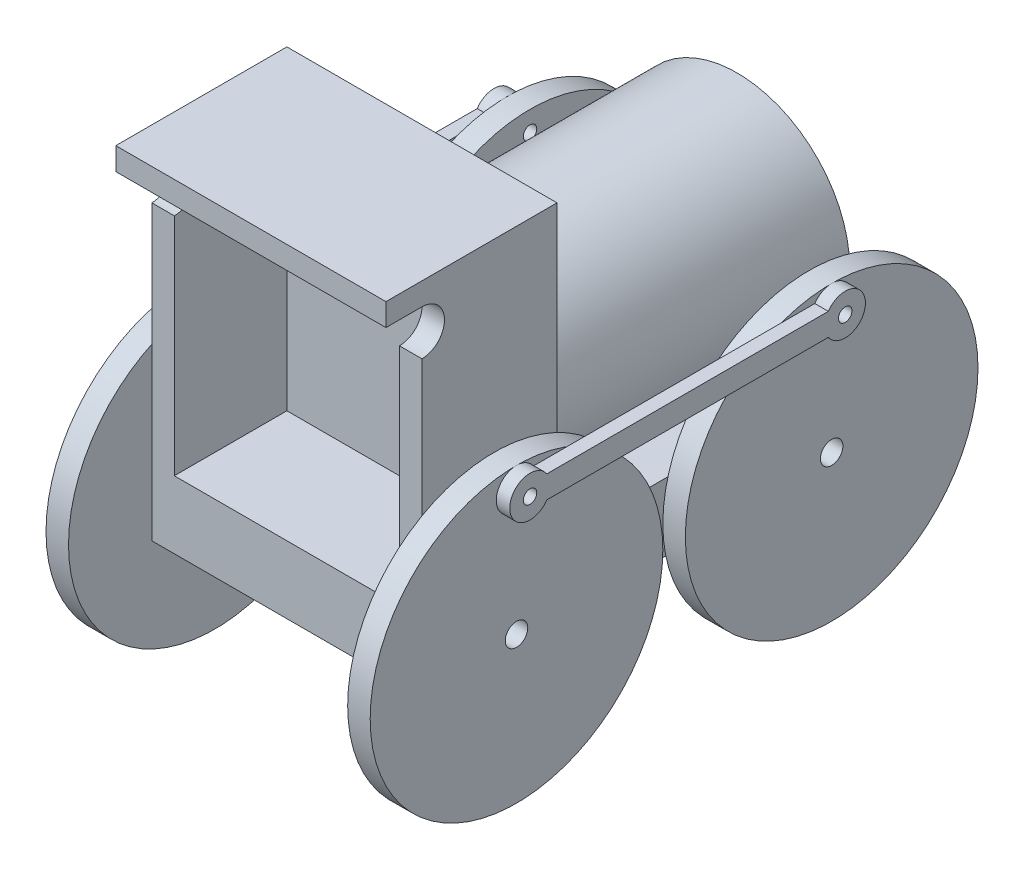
ISO-10303-21;
HEADER;
FILE_DESCRIPTION(('STEP AP214'),'2;1');
FILE_NAME('part.step','',(''),(''),'','','');
FILE_SCHEMA(('AUTOMOTIVE_DESIGN { 1 0 10303 214 1 1 1 1 }'));
ENDSEC;
DATA;
#1=APPLICATION_CONTEXT('core data for automotive mechanical design processes');
#2=APPLICATION_PROTOCOL_DEFINITION('international standard','automotive_design',2000,#1);
#3=PRODUCT_CONTEXT('',#1,'mechanical');
#4=PRODUCT('Part','Part','',(#3));
#5=PRODUCT_RELATED_PRODUCT_CATEGORY('part','',(#4));
#6=PRODUCT_DEFINITION_FORMATION('','',#4);
#7=PRODUCT_DEFINITION_CONTEXT('part definition',#1,'design');
#8=PRODUCT_DEFINITION('design','',#6,#7);
#9=PRODUCT_DEFINITION_SHAPE('','',#8);
#10=(LENGTH_UNIT() NAMED_UNIT(*) SI_UNIT(.MILLI.,.METRE.));
#11=(NAMED_UNIT(*) PLANE_ANGLE_UNIT() SI_UNIT($,.RADIAN.));
#12=(NAMED_UNIT(*) SI_UNIT($,.STERADIAN.) SOLID_ANGLE_UNIT());
#13=UNCERTAINTY_MEASURE_WITH_UNIT(LENGTH_MEASURE(1.E-05),#10,'distance_accuracy_value','');
#14=(GEOMETRIC_REPRESENTATION_CONTEXT(3) GLOBAL_UNCERTAINTY_ASSIGNED_CONTEXT((#13)) GLOBAL_UNIT_ASSIGNED_CONTEXT((#10,
#11,#12)) REPRESENTATION_CONTEXT('',''));
#15=CARTESIAN_POINT('',(0.,0.,0.));
#16=DIRECTION('',(0.,0.,1.));
#17=DIRECTION('',(1.,0.,0.));
#18=AXIS2_PLACEMENT_3D('',#15,#16,#17);
#19=CARTESIAN_POINT('',(0.,32.5,-114.));
#20=DIRECTION('',(0.,0.,-1.));
#21=DIRECTION('',(-1.,0.,0.));
#22=AXIS2_PLACEMENT_3D('',#19,#20,#21);
#23=PLANE('',#22);
#24=CARTESIAN_POINT('',(0.,30.,-114.));
#25=DIRECTION('',(0.,0.,-1.));
#26=DIRECTION('',(-1.,0.,0.));
#27=AXIS2_PLACEMENT_3D('',#24,#25,#26);
#28=CIRCLE('',#27,2.5);
#29=CARTESIAN_POINT('',(-2.5,30.,-114.));
#30=VERTEX_POINT('',#29);
#31=EDGE_CURVE('E64',#30,#30,#28,.T.);
#32=ORIENTED_EDGE('',*,*,#31,.T.);
#33=EDGE_LOOP('',(#32));
#34=FACE_BOUND('',#33,.T.);
#35=ADVANCED_FACE('F42',(#34),#23,.T.);
#36=CARTESIAN_POINT('',(0.,30.,-97.));
#37=DIRECTION('',(0.,0.,1.));
#38=DIRECTION('',(1.,0.,0.));
#39=AXIS2_PLACEMENT_3D('',#36,#37,#38);
#40=PLANE('',#39);
#41=CARTESIAN_POINT('',(0.,30.,-97.));
#42=DIRECTION('',(0.,0.,-1.));
#43=DIRECTION('',(-1.,0.,0.));
#44=AXIS2_PLACEMENT_3D('',#41,#42,#43);
#45=CIRCLE('',#44,16.5);
#46=CARTESIAN_POINT('',(-16.5,30.,-97.));
#47=VERTEX_POINT('',#46);
#48=EDGE_CURVE('E11',#47,#47,#45,.T.);
#49=ORIENTED_EDGE('',*,*,#48,.F.);
#50=EDGE_LOOP('',(#49));
#51=FACE_BOUND('',#50,.T.);
#52=ADVANCED_FACE('F81',(#51),#40,.T.);
#53=CARTESIAN_POINT('',(0.,30.,-114.));
#54=DIRECTION('',(0.,0.,-1.));
#55=DIRECTION('',(-1.,0.,0.));
#56=AXIS2_PLACEMENT_3D('',#53,#54,#55);
#57=CYLINDRICAL_SURFACE('',#56,16.5);
#58=ORIENTED_EDGE('',*,*,#48,.T.);
#59=EDGE_LOOP('',(#58));
#60=FACE_BOUND('',#59,.T.);
#61=CARTESIAN_POINT('',(0.,30.,-100.));
#62=DIRECTION('',(0.,0.,-1.));
#63=DIRECTION('',(-1.,0.,0.));
#64=AXIS2_PLACEMENT_3D('',#61,#62,#63);
#65=CIRCLE('',#64,16.5);
#66=CARTESIAN_POINT('',(16.5,30.,-100.));
#67=VERTEX_POINT('',#66);
#68=EDGE_CURVE('E48',#67,#67,#65,.T.);
#69=ORIENTED_EDGE('',*,*,#68,.F.);
#70=EDGE_LOOP('',(#69));
#71=FACE_BOUND('',#70,.T.);
#72=ADVANCED_FACE('F85',(#60,#71),#57,.T.);
#73=CARTESIAN_POINT('',(0.,30.,-110.));
#74=DIRECTION('',(0.,0.,1.));
#75=DIRECTION('',(1.,0.,0.));
#76=AXIS2_PLACEMENT_3D('',#73,#74,#75);
#77=CONICAL_SURFACE('',#76,5.,0.855052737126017);
#78=CARTESIAN_POINT('',(0.,30.,-110.));
#79=DIRECTION('',(0.,0.,-1.));
#80=DIRECTION('',(-1.,0.,0.));
#81=AXIS2_PLACEMENT_3D('',#78,#79,#80);
#82=CIRCLE('',#81,5.);
#83=CARTESIAN_POINT('',(5.00000000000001,30.,-110.));
#84=VERTEX_POINT('',#83);
#85=EDGE_CURVE('E52',#84,#84,#82,.T.);
#86=CARTESIAN_POINT('',(16.5,30.,-100.));
#87=CARTESIAN_POINT('',(16.3802083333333,30.,-100.104166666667));
#88=CARTESIAN_POINT('',(16.2604166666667,30.,-100.208333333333));
#89=CARTESIAN_POINT('',(16.0208333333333,30.,-100.416666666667));
#90=CARTESIAN_POINT('',(15.9010416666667,30.,-100.520833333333));
#91=CARTESIAN_POINT('',(15.6614583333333,30.,-100.729166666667));
#92=CARTESIAN_POINT('',(15.5416666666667,30.,-100.833333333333));
#93=CARTESIAN_POINT('',(15.3020833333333,30.,-101.041666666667));
#94=CARTESIAN_POINT('',(15.1822916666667,30.,-101.145833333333));
#95=CARTESIAN_POINT('',(14.9427083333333,30.,-101.354166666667));
#96=CARTESIAN_POINT('',(14.8229166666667,30.,-101.458333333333));
#97=CARTESIAN_POINT('',(14.5833333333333,30.,-101.666666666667));
#98=CARTESIAN_POINT('',(14.4635416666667,30.,-101.770833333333));
#99=CARTESIAN_POINT('',(14.2239583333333,30.,-101.979166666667));
#100=CARTESIAN_POINT('',(14.1041666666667,30.,-102.083333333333));
#101=CARTESIAN_POINT('',(13.8645833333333,30.,-102.291666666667));
#102=CARTESIAN_POINT('',(13.7447916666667,30.,-102.395833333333));
#103=CARTESIAN_POINT('',(13.5052083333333,30.,-102.604166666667));
#104=CARTESIAN_POINT('',(13.3854166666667,30.,-102.708333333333));
#105=CARTESIAN_POINT('',(13.1458333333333,30.,-102.916666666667));
#106=CARTESIAN_POINT('',(13.0260416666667,30.,-103.020833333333));
#107=CARTESIAN_POINT('',(12.7864583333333,30.,-103.229166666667));
#108=CARTESIAN_POINT('',(12.6666666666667,30.,-103.333333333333));
#109=CARTESIAN_POINT('',(12.4270833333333,30.,-103.541666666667));
#110=CARTESIAN_POINT('',(12.3072916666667,30.,-103.645833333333));
#111=CARTESIAN_POINT('',(12.0677083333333,30.,-103.854166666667));
#112=CARTESIAN_POINT('',(11.9479166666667,30.,-103.958333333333));
#113=CARTESIAN_POINT('',(11.7083333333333,30.,-104.166666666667));
#114=CARTESIAN_POINT('',(11.5885416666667,30.,-104.270833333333));
#115=CARTESIAN_POINT('',(11.3489583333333,30.,-104.479166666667));
#116=CARTESIAN_POINT('',(11.2291666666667,30.,-104.583333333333));
#117=CARTESIAN_POINT('',(10.9895833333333,30.,-104.791666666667));
#118=CARTESIAN_POINT('',(10.8697916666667,30.,-104.895833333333));
#119=CARTESIAN_POINT('',(10.6302083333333,30.,-105.104166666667));
#120=CARTESIAN_POINT('',(10.5104166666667,30.,-105.208333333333));
#121=CARTESIAN_POINT('',(10.2708333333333,30.,-105.416666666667));
#122=CARTESIAN_POINT('',(10.1510416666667,30.,-105.520833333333));
#123=CARTESIAN_POINT('',(9.91145833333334,30.,-105.729166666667));
#124=CARTESIAN_POINT('',(9.79166666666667,30.,-105.833333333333));
#125=CARTESIAN_POINT('',(9.55208333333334,30.,-106.041666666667));
#126=CARTESIAN_POINT('',(9.43229166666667,30.,-106.145833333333));
#127=CARTESIAN_POINT('',(9.19270833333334,30.,-106.354166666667));
#128=CARTESIAN_POINT('',(9.07291666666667,30.,-106.458333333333));
#129=CARTESIAN_POINT('',(8.83333333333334,30.,-106.666666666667));
#130=CARTESIAN_POINT('',(8.71354166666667,30.,-106.770833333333));
#131=CARTESIAN_POINT('',(8.47395833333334,30.,-106.979166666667));
#132=CARTESIAN_POINT('',(8.35416666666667,30.,-107.083333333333));
#133=CARTESIAN_POINT('',(8.11458333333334,30.,-107.291666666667));
#134=CARTESIAN_POINT('',(7.99479166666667,30.,-107.395833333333));
#135=CARTESIAN_POINT('',(7.75520833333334,30.,-107.604166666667));
#136=CARTESIAN_POINT('',(7.63541666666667,30.,-107.708333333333));
#137=CARTESIAN_POINT('',(7.39583333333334,30.,-107.916666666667));
#138=CARTESIAN_POINT('',(7.27604166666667,30.,-108.020833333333));
#139=CARTESIAN_POINT('',(7.03645833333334,30.,-108.229166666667));
#140=CARTESIAN_POINT('',(6.91666666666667,30.,-108.333333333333));
#141=CARTESIAN_POINT('',(6.67708333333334,30.,-108.541666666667));
#142=CARTESIAN_POINT('',(6.55729166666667,30.,-108.645833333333));
#143=CARTESIAN_POINT('',(6.31770833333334,30.,-108.854166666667));
#144=CARTESIAN_POINT('',(6.19791666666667,30.,-108.958333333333));
#145=CARTESIAN_POINT('',(5.95833333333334,30.,-109.166666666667));
#146=CARTESIAN_POINT('',(5.83854166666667,30.,-109.270833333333));
#147=CARTESIAN_POINT('',(5.59895833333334,30.,-109.479166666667));
#148=CARTESIAN_POINT('',(5.47916666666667,30.,-109.583333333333));
#149=CARTESIAN_POINT('',(5.23958333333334,30.,-109.791666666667));
#150=CARTESIAN_POINT('',(5.11979166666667,30.,-109.895833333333));
#151=CARTESIAN_POINT('',(5.00000000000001,30.,-110.));
#152=B_SPLINE_CURVE_WITH_KNOTS('',3,(#86,#87,#88,#89,#90,#91,#92,#93,#94,#95,#96,#97,#98,#99,
#100,#101,#102,#103,#104,#105,#106,#107,#108,#109,#110,#111,#112,#113,#114,#115,#116,#117,#118,
#119,#120,#121,#122,#123,#124,#125,#126,#127,#128,#129,#130,#131,#132,#133,#134,#135,#136,#137,
#138,#139,#140,#141,#142,#143,#144,#145,#146,#147,#148,#149,#150,#151),.UNSPECIFIED.,.F.,.F.,(4,
2,2,2,2,2,2,2,2,2,2,2,2,2,2,2,2,2,2,2,2,2,2,2,2,2,2,2,2,2,2,2,4),(0.,0.476242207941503,
0.952484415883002,1.42872662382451,1.90496883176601,2.38121103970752,2.85745324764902,
3.33369545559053,3.80993766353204,4.28617987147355,4.76242207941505,5.23866428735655,
5.71490649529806,6.19114870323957,6.66739091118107,7.14363311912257,7.61987532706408,
8.09611753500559,8.57235974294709,9.04860195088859,9.5248441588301,10.0010863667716,
10.4773285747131,10.9535707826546,11.4298129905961,11.9060551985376,12.3822974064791,
12.8585396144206,13.3347818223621,13.8110240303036,14.2872662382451,14.7635084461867,
15.2397506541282),.UNSPECIFIED.);
#153=EDGE_CURVE('BSEAM90',#67,#84,#152,.T.);
#154=ORIENTED_EDGE('',*,*,#68,.T.);
#155=ORIENTED_EDGE('',*,*,#85,.F.);
#156=ORIENTED_EDGE('',*,*,#153,.T.);
#157=ORIENTED_EDGE('',*,*,#153,.F.);
#158=EDGE_LOOP('',(#154,#156,#155,#157));
#159=FACE_BOUND('',#158,.T.);
#160=ADVANCED_FACE('F90',(#159),#77,.T.);
#161=CARTESIAN_POINT('',(0.,30.,-114.));
#162=DIRECTION('',(0.,0.,-1.));
#163=DIRECTION('',(-1.,0.,0.));
#164=AXIS2_PLACEMENT_3D('',#161,#162,#163);
#165=CYLINDRICAL_SURFACE('',#164,5.);
#166=ORIENTED_EDGE('',*,*,#85,.T.);
#167=EDGE_LOOP('',(#166));
#168=FACE_BOUND('',#167,.T.);
#169=CARTESIAN_POINT('',(0.,30.,-112.));
#170=DIRECTION('',(0.,0.,-1.));
#171=DIRECTION('',(-1.,0.,0.));
#172=AXIS2_PLACEMENT_3D('',#169,#170,#171);
#173=CIRCLE('',#172,5.);
#174=CARTESIAN_POINT('',(-5.,30.,-112.));
#175=VERTEX_POINT('',#174);
#176=EDGE_CURVE('E56',#175,#175,#173,.T.);
#177=ORIENTED_EDGE('',*,*,#176,.F.);
#178=EDGE_LOOP('',(#177));
#179=FACE_BOUND('',#178,.T.);
#180=ADVANCED_FACE('F77',(#168,#179),#165,.T.);
#181=CARTESIAN_POINT('',(0.,35.,-112.));
#182=DIRECTION('',(0.,0.,-1.));
#183=DIRECTION('',(-1.,0.,0.));
#184=AXIS2_PLACEMENT_3D('',#181,#182,#183);
#185=PLANE('',#184);
#186=ORIENTED_EDGE('',*,*,#176,.T.);
#187=EDGE_LOOP('',(#186));
#188=FACE_BOUND('',#187,.T.);
#189=CARTESIAN_POINT('',(0.,30.,-112.));
#190=DIRECTION('',(0.,0.,-1.));
#191=DIRECTION('',(-1.,0.,0.));
#192=AXIS2_PLACEMENT_3D('',#189,#190,#191);
#193=CIRCLE('',#192,2.5);
#194=CARTESIAN_POINT('',(-2.5,30.,-112.));
#195=VERTEX_POINT('',#194);
#196=EDGE_CURVE('E61',#195,#195,#193,.T.);
#197=ORIENTED_EDGE('',*,*,#196,.F.);
#198=EDGE_LOOP('',(#197));
#199=FACE_BOUND('',#198,.T.);
#200=ADVANCED_FACE('F71',(#188,#199),#185,.T.);
#201=CARTESIAN_POINT('',(0.,30.,-114.));
#202=DIRECTION('',(0.,0.,-1.));
#203=DIRECTION('',(-1.,0.,0.));
#204=AXIS2_PLACEMENT_3D('',#201,#202,#203);
#205=CYLINDRICAL_SURFACE('',#204,2.5);
#206=ORIENTED_EDGE('',*,*,#196,.T.);
#207=EDGE_LOOP('',(#206));
#208=FACE_BOUND('',#207,.T.);
#209=ORIENTED_EDGE('',*,*,#31,.F.);
#210=EDGE_LOOP('',(#209));
#211=FACE_BOUND('',#210,.T.);
#212=ADVANCED_FACE('F69',(#208,#211),#205,.T.);
#213=CLOSED_SHELL('',(#35,#52,#72,#160,#180,#200,#212));
#214=MANIFOLD_SOLID_BREP('B2',#213);
#215=CARTESIAN_POINT('',(-39.,35.5,-85.));
#216=DIRECTION('',(-1.,0.,0.));
#217=DIRECTION('',(0.,0.,-1.));
#218=AXIS2_PLACEMENT_3D('',#215,#216,#217);
#219=PLANE('',#218);
#220=CARTESIAN_POINT('',(-39.,35.5,-15.));
#221=DIRECTION('',(1.,0.,0.));
#222=DIRECTION('',(0.,0.,-1.));
#223=AXIS2_PLACEMENT_3D('',#220,#221,#222);
#224=CIRCLE('',#223,1.5);
#225=CARTESIAN_POINT('',(-39.,35.5,-16.5));
#226=VERTEX_POINT('',#225);
#227=EDGE_CURVE('E219',#226,#226,#224,.T.);
#228=ORIENTED_EDGE('',*,*,#227,.T.);
#229=EDGE_LOOP('',(#228));
#230=FACE_BOUND('',#229,.T.);
#231=CARTESIAN_POINT('',(-39.,35.5,-85.));
#232=DIRECTION('',(1.,0.,0.));
#233=DIRECTION('',(0.,0.,-1.));
#234=AXIS2_PLACEMENT_3D('',#231,#232,#233);
#235=CIRCLE('',#234,4.5);
#236=CARTESIAN_POINT('',(-39.,33.,-81.2583426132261));
#237=VERTEX_POINT('',#236);
#238=CARTESIAN_POINT('',(-39.,38.,-81.2583426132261));
#239=VERTEX_POINT('',#238);
#240=EDGE_CURVE('E207',#237,#239,#235,.T.);
#241=ORIENTED_EDGE('',*,*,#240,.F.);
#242=DIRECTION('',(0.,0.,1.));
#243=VECTOR('',#242,1.);
#244=CARTESIAN_POINT('',(-39.,33.,-15.));
#245=LINE('',#244,#243);
#246=CARTESIAN_POINT('',(-39.,33.,-18.741657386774));
#247=VERTEX_POINT('',#246);
#248=EDGE_CURVE('E210',#237,#247,#245,.T.);
#249=ORIENTED_EDGE('',*,*,#248,.T.);
#250=CARTESIAN_POINT('',(-39.,35.5,-15.));
#251=DIRECTION('',(1.,0.,0.));
#252=DIRECTION('',(0.,0.,-1.));
#253=AXIS2_PLACEMENT_3D('',#250,#251,#252);
#254=CIRCLE('',#253,4.50000000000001);
#255=CARTESIAN_POINT('',(-39.,38.,-18.7416573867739));
#256=VERTEX_POINT('',#255);
#257=EDGE_CURVE('E198',#256,#247,#254,.T.);
#258=ORIENTED_EDGE('',*,*,#257,.F.);
#259=DIRECTION('',(0.,0.,-1.));
#260=VECTOR('',#259,1.);
#261=CARTESIAN_POINT('',(-39.,38.,-15.));
#262=LINE('',#261,#260);
#263=EDGE_CURVE('E203',#256,#239,#262,.T.);
#264=ORIENTED_EDGE('',*,*,#263,.T.);
#265=EDGE_LOOP('',(#241,#249,#258,#264));
#266=FACE_BOUND('',#265,.T.);
#267=CARTESIAN_POINT('',(-39.,35.5,-85.));
#268=DIRECTION('',(1.,0.,0.));
#269=DIRECTION('',(0.,0.,-1.));
#270=AXIS2_PLACEMENT_3D('',#267,#268,#269);
#271=CIRCLE('',#270,1.50000000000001);
#272=CARTESIAN_POINT('',(-39.,35.5,-86.5));
#273=VERTEX_POINT('',#272);
#274=EDGE_CURVE('E229',#273,#273,#271,.T.);
#275=ORIENTED_EDGE('',*,*,#274,.T.);
#276=EDGE_LOOP('',(#275));
#277=FACE_BOUND('',#276,.T.);
#278=ADVANCED_FACE('F151',(#230,#266,#277),#219,.T.);
#279=CARTESIAN_POINT('',(-36.,35.5,-85.));
#280=DIRECTION('',(-1.,0.,0.));
#281=DIRECTION('',(0.,0.,-1.));
#282=AXIS2_PLACEMENT_3D('',#279,#280,#281);
#283=PLANE('',#282);
#284=CARTESIAN_POINT('',(-36.,35.5,-85.));
#285=DIRECTION('',(1.,0.,0.));
#286=DIRECTION('',(0.,0.,-1.));
#287=AXIS2_PLACEMENT_3D('',#284,#285,#286);
#288=CIRCLE('',#287,4.5);
#289=CARTESIAN_POINT('',(-36.,33.,-81.2583426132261));
#290=VERTEX_POINT('',#289);
#291=CARTESIAN_POINT('',(-36.,38.,-81.2583426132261));
#292=VERTEX_POINT('',#291);
#293=EDGE_CURVE('E215',#290,#292,#288,.T.);
#294=ORIENTED_EDGE('',*,*,#293,.T.);
#295=DIRECTION('',(0.,0.,-1.));
#296=VECTOR('',#295,1.);
#297=CARTESIAN_POINT('',(-36.,38.,-15.));
#298=LINE('',#297,#296);
#299=CARTESIAN_POINT('',(-36.,38.,-18.7416573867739));
#300=VERTEX_POINT('',#299);
#301=EDGE_CURVE('E218',#300,#292,#298,.T.);
#302=ORIENTED_EDGE('',*,*,#301,.F.);
#303=CARTESIAN_POINT('',(-36.,35.5,-15.));
#304=DIRECTION('',(1.,0.,0.));
#305=DIRECTION('',(0.,0.,-1.));
#306=AXIS2_PLACEMENT_3D('',#303,#304,#305);
#307=CIRCLE('',#306,4.50000000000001);
#308=CARTESIAN_POINT('',(-36.,33.,-18.741657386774));
#309=VERTEX_POINT('',#308);
#310=EDGE_CURVE('E201',#300,#309,#307,.T.);
#311=ORIENTED_EDGE('',*,*,#310,.T.);
#312=DIRECTION('',(0.,0.,1.));
#313=VECTOR('',#312,1.);
#314=CARTESIAN_POINT('',(-36.,33.,-15.));
#315=LINE('',#314,#313);
#316=EDGE_CURVE('E222',#290,#309,#315,.T.);
#317=ORIENTED_EDGE('',*,*,#316,.F.);
#318=EDGE_LOOP('',(#294,#302,#311,#317));
#319=FACE_BOUND('',#318,.T.);
#320=CARTESIAN_POINT('',(-36.,35.5,-15.));
#321=DIRECTION('',(1.,0.,0.));
#322=DIRECTION('',(0.,0.,-1.));
#323=AXIS2_PLACEMENT_3D('',#320,#321,#322);
#324=CIRCLE('',#323,1.5);
#325=CARTESIAN_POINT('',(-36.,35.5,-16.5));
#326=VERTEX_POINT('',#325);
#327=EDGE_CURVE('E226',#326,#326,#324,.T.);
#328=ORIENTED_EDGE('',*,*,#327,.F.);
#329=EDGE_LOOP('',(#328));
#330=FACE_BOUND('',#329,.T.);
#331=CARTESIAN_POINT('',(-36.,35.5,-85.));
#332=DIRECTION('',(1.,0.,0.));
#333=DIRECTION('',(0.,0.,-1.));
#334=AXIS2_PLACEMENT_3D('',#331,#332,#333);
#335=CIRCLE('',#334,1.50000000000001);
#336=CARTESIAN_POINT('',(-36.,35.5,-86.5));
#337=VERTEX_POINT('',#336);
#338=EDGE_CURVE('E232',#337,#337,#335,.T.);
#339=ORIENTED_EDGE('',*,*,#338,.F.);
#340=EDGE_LOOP('',(#339));
#341=FACE_BOUND('',#340,.T.);
#342=ADVANCED_FACE('F245',(#319,#330,#341),#283,.F.);
#343=CARTESIAN_POINT('',(-39.,35.5,-85.));
#344=DIRECTION('',(1.,0.,0.));
#345=DIRECTION('',(0.,0.,1.));
#346=AXIS2_PLACEMENT_3D('',#343,#344,#345);
#347=CYLINDRICAL_SURFACE('',#346,4.5);
#348=ORIENTED_EDGE('',*,*,#293,.F.);
#349=DIRECTION('',(1.,0.,0.));
#350=VECTOR('',#349,1.);
#351=CARTESIAN_POINT('',(-39.,33.,-81.2583426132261));
#352=LINE('',#351,#350);
#353=EDGE_CURVE('E168',#237,#290,#352,.T.);
#354=ORIENTED_EDGE('',*,*,#353,.F.);
#355=ORIENTED_EDGE('',*,*,#240,.T.);
#356=DIRECTION('',(1.,0.,0.));
#357=VECTOR('',#356,1.);
#358=CARTESIAN_POINT('',(-39.,38.,-81.2583426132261));
#359=LINE('',#358,#357);
#360=EDGE_CURVE('E40',#239,#292,#359,.T.);
#361=ORIENTED_EDGE('',*,*,#360,.T.);
#362=EDGE_LOOP('',(#348,#354,#355,#361));
#363=FACE_BOUND('',#362,.T.);
#364=ADVANCED_FACE('F153',(#363),#347,.T.);
#365=CARTESIAN_POINT('',(-39.,38.,-15.));
#366=DIRECTION('',(0.,1.,0.));
#367=DIRECTION('',(0.,0.,1.));
#368=AXIS2_PLACEMENT_3D('',#365,#366,#367);
#369=PLANE('',#368);
#370=ORIENTED_EDGE('',*,*,#301,.T.);
#371=ORIENTED_EDGE('',*,*,#360,.F.);
#372=ORIENTED_EDGE('',*,*,#263,.F.);
#373=DIRECTION('',(1.,0.,0.));
#374=VECTOR('',#373,1.);
#375=CARTESIAN_POINT('',(-39.,38.,-18.7416573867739));
#376=LINE('',#375,#374);
#377=EDGE_CURVE('E160',#256,#300,#376,.T.);
#378=ORIENTED_EDGE('',*,*,#377,.T.);
#379=EDGE_LOOP('',(#370,#371,#372,#378));
#380=FACE_BOUND('',#379,.T.);
#381=ADVANCED_FACE('F204',(#380),#369,.T.);
#382=CARTESIAN_POINT('',(-39.,35.5,-15.));
#383=DIRECTION('',(1.,0.,0.));
#384=DIRECTION('',(0.,0.,1.));
#385=AXIS2_PLACEMENT_3D('',#382,#383,#384);
#386=CYLINDRICAL_SURFACE('',#385,4.50000000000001);
#387=ORIENTED_EDGE('',*,*,#310,.F.);
#388=ORIENTED_EDGE('',*,*,#377,.F.);
#389=ORIENTED_EDGE('',*,*,#257,.T.);
#390=DIRECTION('',(1.,0.,0.));
#391=VECTOR('',#390,1.);
#392=CARTESIAN_POINT('',(-39.,33.,-18.741657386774));
#393=LINE('',#392,#391);
#394=EDGE_CURVE('E184',#247,#309,#393,.T.);
#395=ORIENTED_EDGE('',*,*,#394,.T.);
#396=EDGE_LOOP('',(#387,#388,#389,#395));
#397=FACE_BOUND('',#396,.T.);
#398=ADVANCED_FACE('F196',(#397),#386,.T.);
#399=CARTESIAN_POINT('',(-39.,33.,-15.));
#400=DIRECTION('',(0.,-1.,0.));
#401=DIRECTION('',(0.,0.,-1.));
#402=AXIS2_PLACEMENT_3D('',#399,#400,#401);
#403=PLANE('',#402);
#404=ORIENTED_EDGE('',*,*,#316,.T.);
#405=ORIENTED_EDGE('',*,*,#394,.F.);
#406=ORIENTED_EDGE('',*,*,#248,.F.);
#407=ORIENTED_EDGE('',*,*,#353,.T.);
#408=EDGE_LOOP('',(#404,#405,#406,#407));
#409=FACE_BOUND('',#408,.T.);
#410=ADVANCED_FACE('F258',(#409),#403,.T.);
#411=CARTESIAN_POINT('',(-39.,35.5,-15.));
#412=DIRECTION('',(1.,0.,0.));
#413=DIRECTION('',(0.,0.,1.));
#414=AXIS2_PLACEMENT_3D('',#411,#412,#413);
#415=CYLINDRICAL_SURFACE('',#414,1.5);
#416=ORIENTED_EDGE('',*,*,#227,.F.);
#417=EDGE_LOOP('',(#416));
#418=FACE_BOUND('',#417,.T.);
#419=ORIENTED_EDGE('',*,*,#327,.T.);
#420=EDGE_LOOP('',(#419));
#421=FACE_BOUND('',#420,.T.);
#422=ADVANCED_FACE('F241',(#418,#421),#415,.F.);
#423=CARTESIAN_POINT('',(-39.,35.5,-85.));
#424=DIRECTION('',(1.,0.,0.));
#425=DIRECTION('',(0.,0.,1.));
#426=AXIS2_PLACEMENT_3D('',#423,#424,#425);
#427=CYLINDRICAL_SURFACE('',#426,1.50000000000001);
#428=ORIENTED_EDGE('',*,*,#274,.F.);
#429=EDGE_LOOP('',(#428));
#430=FACE_BOUND('',#429,.T.);
#431=ORIENTED_EDGE('',*,*,#338,.T.);
#432=EDGE_LOOP('',(#431));
#433=FACE_BOUND('',#432,.T.);
#434=ADVANCED_FACE('F238',(#430,#433),#427,.F.);
#435=CLOSED_SHELL('',(#278,#342,#364,#381,#398,#410,#422,#434));
#436=MANIFOLD_SOLID_BREP('B6',#435);
#437=CARTESIAN_POINT('',(-36.,7.5,-85.));
#438=DIRECTION('',(1.,0.,0.));
#439=DIRECTION('',(0.,0.,1.));
#440=AXIS2_PLACEMENT_3D('',#437,#438,#439);
#441=CYLINDRICAL_SURFACE('',#440,32.5);
#442=CARTESIAN_POINT('',(-36.,7.5,-85.));
#443=DIRECTION('',(1.,0.,0.));
#444=DIRECTION('',(0.,0.,-1.));
#445=AXIS2_PLACEMENT_3D('',#442,#443,#444);
#446=CIRCLE('',#445,32.5);
#447=CARTESIAN_POINT('',(-36.,7.5,-52.5));
#448=VERTEX_POINT('',#447);
#449=EDGE_CURVE('E150',#448,#448,#446,.T.);
#450=CARTESIAN_POINT('',(-31.,7.5,-85.));
#451=DIRECTION('',(1.,0.,0.));
#452=DIRECTION('',(0.,0.,-1.));
#453=AXIS2_PLACEMENT_3D('',#450,#451,#452);
#454=CIRCLE('',#453,32.5);
#455=CARTESIAN_POINT('',(-31.,7.5,-52.5));
#456=VERTEX_POINT('',#455);
#457=EDGE_CURVE('E332',#456,#456,#454,.T.);
#458=CARTESIAN_POINT('',(-36.,7.5,-52.5));
#459=CARTESIAN_POINT('',(-35.9479166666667,7.5,-52.5));
#460=CARTESIAN_POINT('',(-35.8958333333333,7.5,-52.5));
#461=CARTESIAN_POINT('',(-35.7916666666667,7.5,-52.5));
#462=CARTESIAN_POINT('',(-35.7395833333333,7.5,-52.5));
#463=CARTESIAN_POINT('',(-35.6354166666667,7.5,-52.5));
#464=CARTESIAN_POINT('',(-35.5833333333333,7.5,-52.5));
#465=CARTESIAN_POINT('',(-35.4791666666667,7.5,-52.5));
#466=CARTESIAN_POINT('',(-35.4270833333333,7.5,-52.5));
#467=CARTESIAN_POINT('',(-35.3229166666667,7.5,-52.5));
#468=CARTESIAN_POINT('',(-35.2708333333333,7.5,-52.5));
#469=CARTESIAN_POINT('',(-35.1666666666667,7.5,-52.5));
#470=CARTESIAN_POINT('',(-35.1145833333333,7.5,-52.5));
#471=CARTESIAN_POINT('',(-35.0104166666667,7.5,-52.5));
#472=CARTESIAN_POINT('',(-34.9583333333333,7.5,-52.5));
#473=CARTESIAN_POINT('',(-34.8541666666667,7.5,-52.5));
#474=CARTESIAN_POINT('',(-34.8020833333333,7.5,-52.5));
#475=CARTESIAN_POINT('',(-34.6979166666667,7.5,-52.5));
#476=CARTESIAN_POINT('',(-34.6458333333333,7.5,-52.5));
#477=CARTESIAN_POINT('',(-34.5416666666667,7.5,-52.5));
#478=CARTESIAN_POINT('',(-34.4895833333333,7.5,-52.5));
#479=CARTESIAN_POINT('',(-34.3854166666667,7.5,-52.5));
#480=CARTESIAN_POINT('',(-34.3333333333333,7.5,-52.5));
#481=CARTESIAN_POINT('',(-34.2291666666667,7.5,-52.5));
#482=CARTESIAN_POINT('',(-34.1770833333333,7.5,-52.5));
#483=CARTESIAN_POINT('',(-34.0729166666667,7.5,-52.5));
#484=CARTESIAN_POINT('',(-34.0208333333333,7.5,-52.5));
#485=CARTESIAN_POINT('',(-33.9166666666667,7.5,-52.5));
#486=CARTESIAN_POINT('',(-33.8645833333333,7.5,-52.5));
#487=CARTESIAN_POINT('',(-33.7604166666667,7.5,-52.5));
#488=CARTESIAN_POINT('',(-33.7083333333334,7.5,-52.5));
#489=CARTESIAN_POINT('',(-33.6041666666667,7.5,-52.5));
#490=CARTESIAN_POINT('',(-33.5520833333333,7.5,-52.5));
#491=CARTESIAN_POINT('',(-33.4479166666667,7.5,-52.5));
#492=CARTESIAN_POINT('',(-33.3958333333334,7.5,-52.5));
#493=CARTESIAN_POINT('',(-33.2916666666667,7.5,-52.5));
#494=CARTESIAN_POINT('',(-33.2395833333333,7.5,-52.5));
#495=CARTESIAN_POINT('',(-33.1354166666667,7.5,-52.5));
#496=CARTESIAN_POINT('',(-33.0833333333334,7.5,-52.5));
#497=CARTESIAN_POINT('',(-32.9791666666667,7.5,-52.5));
#498=CARTESIAN_POINT('',(-32.9270833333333,7.5,-52.5));
#499=CARTESIAN_POINT('',(-32.8229166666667,7.5,-52.5));
#500=CARTESIAN_POINT('',(-32.7708333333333,7.5,-52.5));
#501=CARTESIAN_POINT('',(-32.6666666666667,7.5,-52.5));
#502=CARTESIAN_POINT('',(-32.6145833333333,7.5,-52.5));
#503=CARTESIAN_POINT('',(-32.5104166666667,7.5,-52.5));
#504=CARTESIAN_POINT('',(-32.4583333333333,7.5,-52.5));
#505=CARTESIAN_POINT('',(-32.3541666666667,7.5,-52.5));
#506=CARTESIAN_POINT('',(-32.3020833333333,7.5,-52.5));
#507=CARTESIAN_POINT('',(-32.1979166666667,7.5,-52.5));
#508=CARTESIAN_POINT('',(-32.1458333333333,7.5,-52.5));
#509=CARTESIAN_POINT('',(-32.0416666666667,7.5,-52.5));
#510=CARTESIAN_POINT('',(-31.9895833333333,7.5,-52.5));
#511=CARTESIAN_POINT('',(-31.8854166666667,7.5,-52.5));
#512=CARTESIAN_POINT('',(-31.8333333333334,7.5,-52.5));
#513=CARTESIAN_POINT('',(-31.7291666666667,7.5,-52.5));
#514=CARTESIAN_POINT('',(-31.6770833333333,7.5,-52.5));
#515=CARTESIAN_POINT('',(-31.5729166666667,7.5,-52.5));
#516=CARTESIAN_POINT('',(-31.5208333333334,7.5,-52.5));
#517=CARTESIAN_POINT('',(-31.4166666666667,7.5,-52.5));
#518=CARTESIAN_POINT('',(-31.3645833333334,7.5,-52.5));
#519=CARTESIAN_POINT('',(-31.2604166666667,7.5,-52.5));
#520=CARTESIAN_POINT('',(-31.2083333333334,7.5,-52.5));
#521=CARTESIAN_POINT('',(-31.1041666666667,7.5,-52.5));
#522=CARTESIAN_POINT('',(-31.0520833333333,7.5,-52.5));
#523=CARTESIAN_POINT('',(-31.,7.5,-52.5));
#524=B_SPLINE_CURVE_WITH_KNOTS('',3,(#458,#459,#460,#461,#462,#463,#464,#465,#466,#467,#468,
#469,#470,#471,#472,#473,#474,#475,#476,#477,#478,#479,#480,#481,#482,#483,#484,#485,#486,#487,
#488,#489,#490,#491,#492,#493,#494,#495,#496,#497,#498,#499,#500,#501,#502,#503,#504,#505,#506,
#507,#508,#509,#510,#511,#512,#513,#514,#515,#516,#517,#518,#519,#520,#521,#522,#523),
.UNSPECIFIED.,.F.,.F.,(4,2,2,2,2,2,2,2,2,2,2,2,2,2,2,2,2,2,2,2,2,2,2,2,2,2,2,2,2,2,2,2,4),(0.,
0.156249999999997,0.312499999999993,0.468749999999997,0.624999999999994,0.781249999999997,
0.937499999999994,1.09375,1.24999999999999,1.40625,1.56249999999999,1.71875,1.87499999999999,
2.03125,2.1875,2.34374999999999,2.5,2.65624999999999,2.8125,2.96874999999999,3.125,
3.28124999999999,3.4375,3.59374999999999,3.75,3.90624999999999,4.0625,4.21874999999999,4.375,
4.53124999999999,4.68749999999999,4.84374999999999,4.99999999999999),.UNSPECIFIED.);
#525=EDGE_CURVE('BSEAM325',#448,#456,#524,.T.);
#526=ORIENTED_EDGE('',*,*,#449,.T.);
#527=ORIENTED_EDGE('',*,*,#457,.F.);
#528=ORIENTED_EDGE('',*,*,#525,.T.);
#529=ORIENTED_EDGE('',*,*,#525,.F.);
#530=EDGE_LOOP('',(#526,#528,#527,#529));
#531=FACE_BOUND('',#530,.T.);
#532=ADVANCED_FACE('F325',(#531),#441,.T.);
#533=CARTESIAN_POINT('',(-36.,7.5,-85.));
#534=DIRECTION('',(-1.,0.,0.));
#535=DIRECTION('',(0.,0.,-1.));
#536=AXIS2_PLACEMENT_3D('',#533,#534,#535);
#537=PLANE('',#536);
#538=CARTESIAN_POINT('',(-36.,7.5,-85.));
#539=DIRECTION('',(1.,0.,0.));
#540=DIRECTION('',(0.,0.,-1.));
#541=AXIS2_PLACEMENT_3D('',#538,#539,#540);
#542=CIRCLE('',#541,2.5);
#543=CARTESIAN_POINT('',(-36.,7.5,-87.5));
#544=VERTEX_POINT('',#543);
#545=EDGE_CURVE('E349',#544,#544,#542,.T.);
#546=ORIENTED_EDGE('',*,*,#545,.T.);
#547=EDGE_LOOP('',(#546));
#548=FACE_BOUND('',#547,.T.);
#549=CARTESIAN_POINT('',(-36.,35.5,-85.));
#550=DIRECTION('',(1.,0.,0.));
#551=DIRECTION('',(0.,0.,-1.));
#552=AXIS2_PLACEMENT_3D('',#549,#550,#551);
#553=CIRCLE('',#552,1.5);
#554=CARTESIAN_POINT('',(-36.,35.5,-86.5));
#555=VERTEX_POINT('',#554);
#556=EDGE_CURVE('E340',#555,#555,#553,.T.);
#557=ORIENTED_EDGE('',*,*,#556,.T.);
#558=EDGE_LOOP('',(#557));
#559=FACE_BOUND('',#558,.T.);
#560=ORIENTED_EDGE('',*,*,#449,.F.);
#561=EDGE_LOOP('',(#560));
#562=FACE_BOUND('',#561,.T.);
#563=ADVANCED_FACE('F355',(#548,#559,#562),#537,.T.);
#564=CARTESIAN_POINT('',(-31.,7.5,-85.));
#565=DIRECTION('',(-1.,0.,0.));
#566=DIRECTION('',(0.,0.,-1.));
#567=AXIS2_PLACEMENT_3D('',#564,#565,#566);
#568=PLANE('',#567);
#569=CARTESIAN_POINT('',(-31.,7.5,-85.));
#570=DIRECTION('',(1.,0.,0.));
#571=DIRECTION('',(0.,0.,-1.));
#572=AXIS2_PLACEMENT_3D('',#569,#570,#571);
#573=CIRCLE('',#572,2.5);
#574=CARTESIAN_POINT('',(-31.,7.5,-87.5));
#575=VERTEX_POINT('',#574);
#576=EDGE_CURVE('E328',#575,#575,#573,.T.);
#577=ORIENTED_EDGE('',*,*,#576,.F.);
#578=EDGE_LOOP('',(#577));
#579=FACE_BOUND('',#578,.T.);
#580=CARTESIAN_POINT('',(-31.,35.5,-85.));
#581=DIRECTION('',(1.,0.,0.));
#582=DIRECTION('',(0.,0.,-1.));
#583=AXIS2_PLACEMENT_3D('',#580,#581,#582);
#584=CIRCLE('',#583,1.5);
#585=CARTESIAN_POINT('',(-31.,35.5,-86.5));
#586=VERTEX_POINT('',#585);
#587=EDGE_CURVE('E337',#586,#586,#584,.F.);
#588=ORIENTED_EDGE('',*,*,#587,.T.);
#589=EDGE_LOOP('',(#588));
#590=FACE_BOUND('',#589,.T.);
#591=ORIENTED_EDGE('',*,*,#457,.T.);
#592=EDGE_LOOP('',(#591));
#593=FACE_BOUND('',#592,.T.);
#594=ADVANCED_FACE('F364',(#579,#590,#593),#568,.F.);
#595=CARTESIAN_POINT('',(-36.,35.5,-85.));
#596=DIRECTION('',(1.,0.,0.));
#597=DIRECTION('',(0.,0.,1.));
#598=AXIS2_PLACEMENT_3D('',#595,#596,#597);
#599=CYLINDRICAL_SURFACE('',#598,1.5);
#600=ORIENTED_EDGE('',*,*,#556,.F.);
#601=EDGE_LOOP('',(#600));
#602=FACE_BOUND('',#601,.T.);
#603=ORIENTED_EDGE('',*,*,#587,.F.);
#604=EDGE_LOOP('',(#603));
#605=FACE_BOUND('',#604,.T.);
#606=ADVANCED_FACE('F359',(#602,#605),#599,.F.);
#607=CARTESIAN_POINT('',(30.,7.5,-85.));
#608=DIRECTION('',(-1.,0.,0.));
#609=DIRECTION('',(0.,0.,-1.));
#610=AXIS2_PLACEMENT_3D('',#607,#608,#609);
#611=CYLINDRICAL_SURFACE('',#610,2.5);
#612=ORIENTED_EDGE('',*,*,#545,.F.);
#613=EDGE_LOOP('',(#612));
#614=FACE_BOUND('',#613,.T.);
#615=ORIENTED_EDGE('',*,*,#576,.T.);
#616=EDGE_LOOP('',(#615));
#617=FACE_BOUND('',#616,.T.);
#618=ADVANCED_FACE('F357',(#614,#617),#611,.F.);
#619=CLOSED_SHELL('',(#532,#563,#594,#606,#618));
#620=MANIFOLD_SOLID_BREP('B34',#619);
#621=CARTESIAN_POINT('',(-36.,7.49999999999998,-15.));
#622=DIRECTION('',(1.,0.,0.));
#623=DIRECTION('',(0.,0.,1.));
#624=AXIS2_PLACEMENT_3D('',#621,#622,#623);
#625=CYLINDRICAL_SURFACE('',#624,32.5);
#626=CARTESIAN_POINT('',(-36.,7.49999999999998,-15.));
#627=DIRECTION('',(1.,0.,0.));
#628=DIRECTION('',(0.,0.,-1.));
#629=AXIS2_PLACEMENT_3D('',#626,#627,#628);
#630=CIRCLE('',#629,32.5);
#631=CARTESIAN_POINT('',(-36.,7.49999999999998,17.5));
#632=VERTEX_POINT('',#631);
#633=EDGE_CURVE('E324',#632,#632,#630,.T.);
#634=CARTESIAN_POINT('',(-31.,7.49999999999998,-15.));
#635=DIRECTION('',(1.,0.,0.));
#636=DIRECTION('',(0.,0.,-1.));
#637=AXIS2_PLACEMENT_3D('',#634,#635,#636);
#638=CIRCLE('',#637,32.5);
#639=CARTESIAN_POINT('',(-31.,7.49999999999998,17.5));
#640=VERTEX_POINT('',#639);
#641=EDGE_CURVE('E425',#640,#640,#638,.T.);
#642=CARTESIAN_POINT('',(-36.,7.49999999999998,17.5));
#643=CARTESIAN_POINT('',(-35.9479166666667,7.49999999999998,17.5));
#644=CARTESIAN_POINT('',(-35.8958333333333,7.49999999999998,17.5));
#645=CARTESIAN_POINT('',(-35.7916666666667,7.49999999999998,17.5));
#646=CARTESIAN_POINT('',(-35.7395833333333,7.49999999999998,17.5));
#647=CARTESIAN_POINT('',(-35.6354166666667,7.49999999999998,17.5));
#648=CARTESIAN_POINT('',(-35.5833333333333,7.49999999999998,17.5));
#649=CARTESIAN_POINT('',(-35.4791666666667,7.49999999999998,17.5));
#650=CARTESIAN_POINT('',(-35.4270833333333,7.49999999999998,17.5));
#651=CARTESIAN_POINT('',(-35.3229166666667,7.49999999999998,17.5));
#652=CARTESIAN_POINT('',(-35.2708333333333,7.49999999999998,17.5));
#653=CARTESIAN_POINT('',(-35.1666666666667,7.49999999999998,17.5));
#654=CARTESIAN_POINT('',(-35.1145833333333,7.49999999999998,17.5));
#655=CARTESIAN_POINT('',(-35.0104166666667,7.49999999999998,17.5));
#656=CARTESIAN_POINT('',(-34.9583333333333,7.49999999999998,17.5));
#657=CARTESIAN_POINT('',(-34.8541666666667,7.49999999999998,17.5));
#658=CARTESIAN_POINT('',(-34.8020833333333,7.49999999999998,17.5));
#659=CARTESIAN_POINT('',(-34.6979166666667,7.49999999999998,17.5));
#660=CARTESIAN_POINT('',(-34.6458333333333,7.49999999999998,17.5));
#661=CARTESIAN_POINT('',(-34.5416666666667,7.49999999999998,17.5));
#662=CARTESIAN_POINT('',(-34.4895833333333,7.49999999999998,17.5));
#663=CARTESIAN_POINT('',(-34.3854166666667,7.49999999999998,17.5));
#664=CARTESIAN_POINT('',(-34.3333333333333,7.49999999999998,17.5));
#665=CARTESIAN_POINT('',(-34.2291666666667,7.49999999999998,17.5));
#666=CARTESIAN_POINT('',(-34.1770833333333,7.49999999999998,17.5));
#667=CARTESIAN_POINT('',(-34.0729166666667,7.49999999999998,17.5));
#668=CARTESIAN_POINT('',(-34.0208333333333,7.49999999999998,17.5));
#669=CARTESIAN_POINT('',(-33.9166666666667,7.49999999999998,17.5));
#670=CARTESIAN_POINT('',(-33.8645833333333,7.49999999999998,17.5));
#671=CARTESIAN_POINT('',(-33.7604166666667,7.49999999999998,17.5));
#672=CARTESIAN_POINT('',(-33.7083333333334,7.49999999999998,17.5));
#673=CARTESIAN_POINT('',(-33.6041666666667,7.49999999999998,17.5));
#674=CARTESIAN_POINT('',(-33.5520833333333,7.49999999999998,17.5));
#675=CARTESIAN_POINT('',(-33.4479166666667,7.49999999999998,17.5));
#676=CARTESIAN_POINT('',(-33.3958333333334,7.49999999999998,17.5));
#677=CARTESIAN_POINT('',(-33.2916666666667,7.49999999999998,17.5));
#678=CARTESIAN_POINT('',(-33.2395833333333,7.49999999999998,17.5));
#679=CARTESIAN_POINT('',(-33.1354166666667,7.49999999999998,17.5));
#680=CARTESIAN_POINT('',(-33.0833333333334,7.49999999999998,17.5));
#681=CARTESIAN_POINT('',(-32.9791666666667,7.49999999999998,17.5));
#682=CARTESIAN_POINT('',(-32.9270833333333,7.49999999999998,17.5));
#683=CARTESIAN_POINT('',(-32.8229166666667,7.49999999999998,17.5));
#684=CARTESIAN_POINT('',(-32.7708333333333,7.49999999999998,17.5));
#685=CARTESIAN_POINT('',(-32.6666666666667,7.49999999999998,17.5));
#686=CARTESIAN_POINT('',(-32.6145833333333,7.49999999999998,17.5));
#687=CARTESIAN_POINT('',(-32.5104166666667,7.49999999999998,17.5));
#688=CARTESIAN_POINT('',(-32.4583333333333,7.49999999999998,17.5));
#689=CARTESIAN_POINT('',(-32.3541666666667,7.49999999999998,17.5));
#690=CARTESIAN_POINT('',(-32.3020833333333,7.49999999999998,17.5));
#691=CARTESIAN_POINT('',(-32.1979166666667,7.49999999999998,17.5));
#692=CARTESIAN_POINT('',(-32.1458333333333,7.49999999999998,17.5));
#693=CARTESIAN_POINT('',(-32.0416666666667,7.49999999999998,17.5));
#694=CARTESIAN_POINT('',(-31.9895833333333,7.49999999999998,17.5));
#695=CARTESIAN_POINT('',(-31.8854166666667,7.49999999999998,17.5));
#696=CARTESIAN_POINT('',(-31.8333333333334,7.49999999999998,17.5));
#697=CARTESIAN_POINT('',(-31.7291666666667,7.49999999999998,17.5));
#698=CARTESIAN_POINT('',(-31.6770833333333,7.49999999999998,17.5));
#699=CARTESIAN_POINT('',(-31.5729166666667,7.49999999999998,17.5));
#700=CARTESIAN_POINT('',(-31.5208333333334,7.49999999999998,17.5));
#701=CARTESIAN_POINT('',(-31.4166666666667,7.49999999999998,17.5));
#702=CARTESIAN_POINT('',(-31.3645833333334,7.49999999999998,17.5));
#703=CARTESIAN_POINT('',(-31.2604166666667,7.49999999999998,17.5));
#704=CARTESIAN_POINT('',(-31.2083333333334,7.49999999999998,17.5));
#705=CARTESIAN_POINT('',(-31.1041666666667,7.49999999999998,17.5));
#706=CARTESIAN_POINT('',(-31.0520833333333,7.49999999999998,17.5));
#707=CARTESIAN_POINT('',(-31.,7.49999999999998,17.5));
#708=B_SPLINE_CURVE_WITH_KNOTS('',3,(#642,#643,#644,#645,#646,#647,#648,#649,#650,#651,#652,
#653,#654,#655,#656,#657,#658,#659,#660,#661,#662,#663,#664,#665,#666,#667,#668,#669,#670,#671,
#672,#673,#674,#675,#676,#677,#678,#679,#680,#681,#682,#683,#684,#685,#686,#687,#688,#689,#690,
#691,#692,#693,#694,#695,#696,#697,#698,#699,#700,#701,#702,#703,#704,#705,#706,#707),
.UNSPECIFIED.,.F.,.F.,(4,2,2,2,2,2,2,2,2,2,2,2,2,2,2,2,2,2,2,2,2,2,2,2,2,2,2,2,2,2,2,2,4),(0.,
0.156249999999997,0.312499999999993,0.468749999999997,0.624999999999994,0.781249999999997,
0.937499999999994,1.09375,1.24999999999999,1.40625,1.56249999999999,1.71875,1.87499999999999,
2.03125,2.1875,2.34374999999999,2.5,2.65624999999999,2.8125,2.96874999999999,3.125,
3.28124999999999,3.4375,3.59374999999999,3.75,3.90624999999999,4.0625,4.21874999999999,4.375,
4.53124999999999,4.68749999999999,4.84374999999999,4.99999999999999),.UNSPECIFIED.);
#709=EDGE_CURVE('BSEAM418',#632,#640,#708,.T.);
#710=ORIENTED_EDGE('',*,*,#633,.T.);
#711=ORIENTED_EDGE('',*,*,#641,.F.);
#712=ORIENTED_EDGE('',*,*,#709,.T.);
#713=ORIENTED_EDGE('',*,*,#709,.F.);
#714=EDGE_LOOP('',(#710,#712,#711,#713));
#715=FACE_BOUND('',#714,.T.);
#716=ADVANCED_FACE('F418',(#715),#625,.T.);
#717=CARTESIAN_POINT('',(-36.,7.49999999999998,-15.));
#718=DIRECTION('',(-1.,0.,0.));
#719=DIRECTION('',(0.,0.,-1.));
#720=AXIS2_PLACEMENT_3D('',#717,#718,#719);
#721=PLANE('',#720);
#722=CARTESIAN_POINT('',(-36.,7.49999999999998,-15.));
#723=DIRECTION('',(1.,0.,0.));
#724=DIRECTION('',(0.,0.,-1.));
#725=AXIS2_PLACEMENT_3D('',#722,#723,#724);
#726=CIRCLE('',#725,2.5);
#727=CARTESIAN_POINT('',(-36.,7.49999999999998,-17.5));
#728=VERTEX_POINT('',#727);
#729=EDGE_CURVE('E442',#728,#728,#726,.T.);
#730=ORIENTED_EDGE('',*,*,#729,.T.);
#731=EDGE_LOOP('',(#730));
#732=FACE_BOUND('',#731,.T.);
#733=CARTESIAN_POINT('',(-36.,35.5,-15.));
#734=DIRECTION('',(1.,0.,0.));
#735=DIRECTION('',(0.,0.,-1.));
#736=AXIS2_PLACEMENT_3D('',#733,#734,#735);
#737=CIRCLE('',#736,1.5);
#738=CARTESIAN_POINT('',(-36.,35.5,-16.5));
#739=VERTEX_POINT('',#738);
#740=EDGE_CURVE('E433',#739,#739,#737,.T.);
#741=ORIENTED_EDGE('',*,*,#740,.T.);
#742=EDGE_LOOP('',(#741));
#743=FACE_BOUND('',#742,.T.);
#744=ORIENTED_EDGE('',*,*,#633,.F.);
#745=EDGE_LOOP('',(#744));
#746=FACE_BOUND('',#745,.T.);
#747=ADVANCED_FACE('F448',(#732,#743,#746),#721,.T.);
#748=CARTESIAN_POINT('',(-31.,7.49999999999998,-15.));
#749=DIRECTION('',(-1.,0.,0.));
#750=DIRECTION('',(0.,0.,-1.));
#751=AXIS2_PLACEMENT_3D('',#748,#749,#750);
#752=PLANE('',#751);
#753=CARTESIAN_POINT('',(-31.,7.49999999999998,-15.));
#754=DIRECTION('',(1.,0.,0.));
#755=DIRECTION('',(0.,0.,-1.));
#756=AXIS2_PLACEMENT_3D('',#753,#754,#755);
#757=CIRCLE('',#756,2.5);
#758=CARTESIAN_POINT('',(-31.,7.49999999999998,-17.5));
#759=VERTEX_POINT('',#758);
#760=EDGE_CURVE('E421',#759,#759,#757,.T.);
#761=ORIENTED_EDGE('',*,*,#760,.F.);
#762=EDGE_LOOP('',(#761));
#763=FACE_BOUND('',#762,.T.);
#764=CARTESIAN_POINT('',(-31.,35.5,-15.));
#765=DIRECTION('',(1.,0.,0.));
#766=DIRECTION('',(0.,0.,-1.));
#767=AXIS2_PLACEMENT_3D('',#764,#765,#766);
#768=CIRCLE('',#767,1.5);
#769=CARTESIAN_POINT('',(-31.,35.5,-16.5));
#770=VERTEX_POINT('',#769);
#771=EDGE_CURVE('E430',#770,#770,#768,.F.);
#772=ORIENTED_EDGE('',*,*,#771,.T.);
#773=EDGE_LOOP('',(#772));
#774=FACE_BOUND('',#773,.T.);
#775=ORIENTED_EDGE('',*,*,#641,.T.);
#776=EDGE_LOOP('',(#775));
#777=FACE_BOUND('',#776,.T.);
#778=ADVANCED_FACE('F457',(#763,#774,#777),#752,.F.);
#779=CARTESIAN_POINT('',(-36.,35.5,-15.));
#780=DIRECTION('',(1.,0.,0.));
#781=DIRECTION('',(0.,0.,1.));
#782=AXIS2_PLACEMENT_3D('',#779,#780,#781);
#783=CYLINDRICAL_SURFACE('',#782,1.5);
#784=ORIENTED_EDGE('',*,*,#740,.F.);
#785=EDGE_LOOP('',(#784));
#786=FACE_BOUND('',#785,.T.);
#787=ORIENTED_EDGE('',*,*,#771,.F.);
#788=EDGE_LOOP('',(#787));
#789=FACE_BOUND('',#788,.T.);
#790=ADVANCED_FACE('F452',(#786,#789),#783,.F.);
#791=CARTESIAN_POINT('',(30.,7.49999999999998,-15.));
#792=DIRECTION('',(-1.,0.,0.));
#793=DIRECTION('',(0.,0.,-1.));
#794=AXIS2_PLACEMENT_3D('',#791,#792,#793);
#795=CYLINDRICAL_SURFACE('',#794,2.5);
#796=ORIENTED_EDGE('',*,*,#729,.F.);
#797=EDGE_LOOP('',(#796));
#798=FACE_BOUND('',#797,.T.);
#799=ORIENTED_EDGE('',*,*,#760,.T.);
#800=EDGE_LOOP('',(#799));
#801=FACE_BOUND('',#800,.T.);
#802=ADVANCED_FACE('F450',(#798,#801),#795,.F.);
#803=CLOSED_SHELL('',(#716,#747,#778,#790,#802));
#804=MANIFOLD_SOLID_BREP('B145',#803);
#805=CARTESIAN_POINT('',(39.,35.5,-85.));
#806=DIRECTION('',(1.,0.,0.));
#807=DIRECTION('',(0.,0.,-1.));
#808=AXIS2_PLACEMENT_3D('',#805,#806,#807);
#809=PLANE('',#808);
#810=CARTESIAN_POINT('',(39.,35.5,-15.));
#811=DIRECTION('',(1.,0.,0.));
#812=DIRECTION('',(0.,0.,-1.));
#813=AXIS2_PLACEMENT_3D('',#810,#811,#812);
#814=CIRCLE('',#813,1.5);
#815=CARTESIAN_POINT('',(39.,35.5,-16.5));
#816=VERTEX_POINT('',#815);
#817=EDGE_CURVE('E577',#816,#816,#814,.T.);
#818=ORIENTED_EDGE('',*,*,#817,.F.);
#819=EDGE_LOOP('',(#818));
#820=FACE_BOUND('',#819,.T.);
#821=CARTESIAN_POINT('',(39.,35.5,-85.));
#822=DIRECTION('',(1.,0.,0.));
#823=DIRECTION('',(0.,0.,-1.));
#824=AXIS2_PLACEMENT_3D('',#821,#822,#823);
#825=CIRCLE('',#824,4.5);
#826=CARTESIAN_POINT('',(39.,33.,-81.2583426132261));
#827=VERTEX_POINT('',#826);
#828=CARTESIAN_POINT('',(39.,38.,-81.2583426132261));
#829=VERTEX_POINT('',#828);
#830=EDGE_CURVE('E551',#827,#829,#825,.T.);
#831=ORIENTED_EDGE('',*,*,#830,.T.);
#832=DIRECTION('',(0.,0.,-1.));
#833=VECTOR('',#832,1.);
#834=CARTESIAN_POINT('',(39.,38.,-15.));
#835=LINE('',#834,#833);
#836=CARTESIAN_POINT('',(39.,38.,-18.7416573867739));
#837=VERTEX_POINT('',#836);
#838=EDGE_CURVE('E559',#837,#829,#835,.T.);
#839=ORIENTED_EDGE('',*,*,#838,.F.);
#840=CARTESIAN_POINT('',(39.,35.5,-15.));
#841=DIRECTION('',(1.,0.,0.));
#842=DIRECTION('',(0.,0.,-1.));
#843=AXIS2_PLACEMENT_3D('',#840,#841,#842);
#844=CIRCLE('',#843,4.50000000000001);
#845=CARTESIAN_POINT('',(39.,33.,-18.741657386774));
#846=VERTEX_POINT('',#845);
#847=EDGE_CURVE('E564',#837,#846,#844,.T.);
#848=ORIENTED_EDGE('',*,*,#847,.T.);
#849=DIRECTION('',(0.,0.,1.));
#850=VECTOR('',#849,1.);
#851=CARTESIAN_POINT('',(39.,33.,-15.));
#852=LINE('',#851,#850);
#853=EDGE_CURVE('E566',#827,#846,#852,.T.);
#854=ORIENTED_EDGE('',*,*,#853,.F.);
#855=EDGE_LOOP('',(#831,#839,#848,#854));
#856=FACE_BOUND('',#855,.T.);
#857=CARTESIAN_POINT('',(39.,35.5,-85.));
#858=DIRECTION('',(1.,0.,0.));
#859=DIRECTION('',(0.,0.,-1.));
#860=AXIS2_PLACEMENT_3D('',#857,#858,#859);
#861=CIRCLE('',#860,1.50000000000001);
#862=CARTESIAN_POINT('',(39.,35.5,-86.5));
#863=VERTEX_POINT('',#862);
#864=EDGE_CURVE('E615',#863,#863,#861,.T.);
#865=ORIENTED_EDGE('',*,*,#864,.F.);
#866=EDGE_LOOP('',(#865));
#867=FACE_BOUND('',#866,.T.);
#868=ADVANCED_FACE('F509',(#820,#856,#867),#809,.T.);
#869=CARTESIAN_POINT('',(36.,35.5,-85.));
#870=DIRECTION('',(1.,0.,0.));
#871=DIRECTION('',(0.,0.,-1.));
#872=AXIS2_PLACEMENT_3D('',#869,#870,#871);
#873=PLANE('',#872);
#874=CARTESIAN_POINT('',(36.,35.5,-85.));
#875=DIRECTION('',(1.,0.,0.));
#876=DIRECTION('',(0.,0.,-1.));
#877=AXIS2_PLACEMENT_3D('',#874,#875,#876);
#878=CIRCLE('',#877,4.5);
#879=CARTESIAN_POINT('',(36.,33.,-81.2583426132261));
#880=VERTEX_POINT('',#879);
#881=CARTESIAN_POINT('',(36.,38.,-81.2583426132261));
#882=VERTEX_POINT('',#881);
#883=EDGE_CURVE('E575',#880,#882,#878,.T.);
#884=ORIENTED_EDGE('',*,*,#883,.F.);
#885=DIRECTION('',(0.,0.,1.));
#886=VECTOR('',#885,1.);
#887=CARTESIAN_POINT('',(36.,33.,-15.));
#888=LINE('',#887,#886);
#889=CARTESIAN_POINT('',(36.,33.,-18.741657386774));
#890=VERTEX_POINT('',#889);
#891=EDGE_CURVE('E570',#880,#890,#888,.T.);
#892=ORIENTED_EDGE('',*,*,#891,.T.);
#893=CARTESIAN_POINT('',(36.,35.5,-15.));
#894=DIRECTION('',(1.,0.,0.));
#895=DIRECTION('',(0.,0.,-1.));
#896=AXIS2_PLACEMENT_3D('',#893,#894,#895);
#897=CIRCLE('',#896,4.50000000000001);
#898=CARTESIAN_POINT('',(36.,38.,-18.7416573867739));
#899=VERTEX_POINT('',#898);
#900=EDGE_CURVE('E579',#899,#890,#897,.T.);
#901=ORIENTED_EDGE('',*,*,#900,.F.);
#902=DIRECTION('',(0.,0.,-1.));
#903=VECTOR('',#902,1.);
#904=CARTESIAN_POINT('',(36.,38.,-15.));
#905=LINE('',#904,#903);
#906=EDGE_CURVE('E561',#899,#882,#905,.T.);
#907=ORIENTED_EDGE('',*,*,#906,.T.);
#908=EDGE_LOOP('',(#884,#892,#901,#907));
#909=FACE_BOUND('',#908,.T.);
#910=CARTESIAN_POINT('',(36.,35.5,-15.));
#911=DIRECTION('',(1.,0.,0.));
#912=DIRECTION('',(0.,0.,-1.));
#913=AXIS2_PLACEMENT_3D('',#910,#911,#912);
#914=CIRCLE('',#913,1.5);
#915=CARTESIAN_POINT('',(36.,35.5,-16.5));
#916=VERTEX_POINT('',#915);
#917=EDGE_CURVE('E621',#916,#916,#914,.T.);
#918=ORIENTED_EDGE('',*,*,#917,.T.);
#919=EDGE_LOOP('',(#918));
#920=FACE_BOUND('',#919,.T.);
#921=CARTESIAN_POINT('',(36.,35.5,-85.));
#922=DIRECTION('',(1.,0.,0.));
#923=DIRECTION('',(0.,0.,-1.));
#924=AXIS2_PLACEMENT_3D('',#921,#922,#923);
#925=CIRCLE('',#924,1.50000000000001);
#926=CARTESIAN_POINT('',(36.,35.5,-86.5));
#927=VERTEX_POINT('',#926);
#928=EDGE_CURVE('E618',#927,#927,#925,.T.);
#929=ORIENTED_EDGE('',*,*,#928,.T.);
#930=EDGE_LOOP('',(#929));
#931=FACE_BOUND('',#930,.T.);
#932=ADVANCED_FACE('F585',(#909,#920,#931),#873,.F.);
#933=CARTESIAN_POINT('',(39.,35.5,-85.));
#934=DIRECTION('',(-1.,0.,0.));
#935=DIRECTION('',(0.,0.,1.));
#936=AXIS2_PLACEMENT_3D('',#933,#934,#935);
#937=CYLINDRICAL_SURFACE('',#936,4.5);
#938=ORIENTED_EDGE('',*,*,#883,.T.);
#939=DIRECTION('',(-1.,0.,0.));
#940=VECTOR('',#939,1.);
#941=CARTESIAN_POINT('',(39.,38.,-81.2583426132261));
#942=LINE('',#941,#940);
#943=EDGE_CURVE('E416',#829,#882,#942,.T.);
#944=ORIENTED_EDGE('',*,*,#943,.F.);
#945=ORIENTED_EDGE('',*,*,#830,.F.);
#946=DIRECTION('',(-1.,0.,0.));
#947=VECTOR('',#946,1.);
#948=CARTESIAN_POINT('',(39.,33.,-81.2583426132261));
#949=LINE('',#948,#947);
#950=EDGE_CURVE('E526',#827,#880,#949,.T.);
#951=ORIENTED_EDGE('',*,*,#950,.T.);
#952=EDGE_LOOP('',(#938,#944,#945,#951));
#953=FACE_BOUND('',#952,.T.);
#954=ADVANCED_FACE('F511',(#953),#937,.T.);
#955=CARTESIAN_POINT('',(39.,38.,-15.));
#956=DIRECTION('',(0.,1.,0.));
#957=DIRECTION('',(0.,0.,1.));
#958=AXIS2_PLACEMENT_3D('',#955,#956,#957);
#959=PLANE('',#958);
#960=ORIENTED_EDGE('',*,*,#906,.F.);
#961=DIRECTION('',(-1.,0.,0.));
#962=VECTOR('',#961,1.);
#963=CARTESIAN_POINT('',(39.,38.,-18.7416573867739));
#964=LINE('',#963,#962);
#965=EDGE_CURVE('E518',#837,#899,#964,.T.);
#966=ORIENTED_EDGE('',*,*,#965,.F.);
#967=ORIENTED_EDGE('',*,*,#838,.T.);
#968=ORIENTED_EDGE('',*,*,#943,.T.);
#969=EDGE_LOOP('',(#960,#966,#967,#968));
#970=FACE_BOUND('',#969,.T.);
#971=ADVANCED_FACE('F558',(#970),#959,.T.);
#972=CARTESIAN_POINT('',(39.,35.5,-15.));
#973=DIRECTION('',(-1.,0.,0.));
#974=DIRECTION('',(0.,0.,1.));
#975=AXIS2_PLACEMENT_3D('',#972,#973,#974);
#976=CYLINDRICAL_SURFACE('',#975,4.50000000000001);
#977=ORIENTED_EDGE('',*,*,#900,.T.);
#978=DIRECTION('',(-1.,0.,0.));
#979=VECTOR('',#978,1.);
#980=CARTESIAN_POINT('',(39.,33.,-18.741657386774));
#981=LINE('',#980,#979);
#982=EDGE_CURVE('E540',#846,#890,#981,.T.);
#983=ORIENTED_EDGE('',*,*,#982,.F.);
#984=ORIENTED_EDGE('',*,*,#847,.F.);
#985=ORIENTED_EDGE('',*,*,#965,.T.);
#986=EDGE_LOOP('',(#977,#983,#984,#985));
#987=FACE_BOUND('',#986,.T.);
#988=ADVANCED_FACE('F565',(#987),#976,.T.);
#989=CARTESIAN_POINT('',(39.,33.,-15.));
#990=DIRECTION('',(0.,-1.,0.));
#991=DIRECTION('',(0.,0.,-1.));
#992=AXIS2_PLACEMENT_3D('',#989,#990,#991);
#993=PLANE('',#992);
#994=ORIENTED_EDGE('',*,*,#891,.F.);
#995=ORIENTED_EDGE('',*,*,#950,.F.);
#996=ORIENTED_EDGE('',*,*,#853,.T.);
#997=ORIENTED_EDGE('',*,*,#982,.T.);
#998=EDGE_LOOP('',(#994,#995,#996,#997));
#999=FACE_BOUND('',#998,.T.);
#1000=ADVANCED_FACE('F587',(#999),#993,.T.);
#1001=CARTESIAN_POINT('',(39.,35.5,-15.));
#1002=DIRECTION('',(-1.,0.,0.));
#1003=DIRECTION('',(0.,0.,1.));
#1004=AXIS2_PLACEMENT_3D('',#1001,#1002,#1003);
#1005=CYLINDRICAL_SURFACE('',#1004,1.5);
#1006=ORIENTED_EDGE('',*,*,#817,.T.);
#1007=EDGE_LOOP('',(#1006));
#1008=FACE_BOUND('',#1007,.T.);
#1009=ORIENTED_EDGE('',*,*,#917,.F.);
#1010=EDGE_LOOP('',(#1009));
#1011=FACE_BOUND('',#1010,.T.);
#1012=ADVANCED_FACE('F589',(#1008,#1011),#1005,.F.);
#1013=CARTESIAN_POINT('',(39.,35.5,-85.));
#1014=DIRECTION('',(-1.,0.,0.));
#1015=DIRECTION('',(0.,0.,1.));
#1016=AXIS2_PLACEMENT_3D('',#1013,#1014,#1015);
#1017=CYLINDRICAL_SURFACE('',#1016,1.50000000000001);
#1018=ORIENTED_EDGE('',*,*,#864,.T.);
#1019=EDGE_LOOP('',(#1018));
#1020=FACE_BOUND('',#1019,.T.);
#1021=ORIENTED_EDGE('',*,*,#928,.F.);
#1022=EDGE_LOOP('',(#1021));
#1023=FACE_BOUND('',#1022,.T.);
#1024=ADVANCED_FACE('F595',(#1020,#1023),#1017,.F.);
#1025=CLOSED_SHELL('',(#868,#932,#954,#971,#988,#1000,#1012,#1024));
#1026=MANIFOLD_SOLID_BREP('B319',#1025);
#1027=CARTESIAN_POINT('',(36.,7.5,-85.));
#1028=DIRECTION('',(-1.,0.,0.));
#1029=DIRECTION('',(0.,0.,1.));
#1030=AXIS2_PLACEMENT_3D('',#1027,#1028,#1029);
#1031=CYLINDRICAL_SURFACE('',#1030,32.5);
#1032=CARTESIAN_POINT('',(36.,7.5,-85.));
#1033=DIRECTION('',(1.,0.,0.));
#1034=DIRECTION('',(0.,0.,-1.));
#1035=AXIS2_PLACEMENT_3D('',#1032,#1033,#1034);
#1036=CIRCLE('',#1035,32.5);
#1037=CARTESIAN_POINT('',(36.,7.5,-52.5));
#1038=VERTEX_POINT('',#1037);
#1039=EDGE_CURVE('E508',#1038,#1038,#1036,.T.);
#1040=CARTESIAN_POINT('',(31.,7.5,-85.));
#1041=DIRECTION('',(1.,0.,0.));
#1042=DIRECTION('',(0.,0.,-1.));
#1043=AXIS2_PLACEMENT_3D('',#1040,#1041,#1042);
#1044=CIRCLE('',#1043,32.5);
#1045=CARTESIAN_POINT('',(31.,7.5,-52.5));
#1046=VERTEX_POINT('',#1045);
#1047=EDGE_CURVE('E690',#1046,#1046,#1044,.T.);
#1048=CARTESIAN_POINT('',(36.,7.5,-52.5));
#1049=CARTESIAN_POINT('',(35.9479166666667,7.5,-52.5));
#1050=CARTESIAN_POINT('',(35.8958333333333,7.5,-52.5));
#1051=CARTESIAN_POINT('',(35.7916666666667,7.5,-52.5));
#1052=CARTESIAN_POINT('',(35.7395833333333,7.5,-52.5));
#1053=CARTESIAN_POINT('',(35.6354166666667,7.5,-52.5));
#1054=CARTESIAN_POINT('',(35.5833333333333,7.5,-52.5));
#1055=CARTESIAN_POINT('',(35.4791666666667,7.5,-52.5));
#1056=CARTESIAN_POINT('',(35.4270833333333,7.5,-52.5));
#1057=CARTESIAN_POINT('',(35.3229166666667,7.5,-52.5));
#1058=CARTESIAN_POINT('',(35.2708333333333,7.5,-52.5));
#1059=CARTESIAN_POINT('',(35.1666666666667,7.5,-52.5));
#1060=CARTESIAN_POINT('',(35.1145833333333,7.5,-52.5));
#1061=CARTESIAN_POINT('',(35.0104166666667,7.5,-52.5));
#1062=CARTESIAN_POINT('',(34.9583333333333,7.5,-52.5));
#1063=CARTESIAN_POINT('',(34.8541666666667,7.5,-52.5));
#1064=CARTESIAN_POINT('',(34.8020833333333,7.5,-52.5));
#1065=CARTESIAN_POINT('',(34.6979166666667,7.5,-52.5));
#1066=CARTESIAN_POINT('',(34.6458333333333,7.5,-52.5));
#1067=CARTESIAN_POINT('',(34.5416666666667,7.5,-52.5));
#1068=CARTESIAN_POINT('',(34.4895833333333,7.5,-52.5));
#1069=CARTESIAN_POINT('',(34.3854166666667,7.5,-52.5));
#1070=CARTESIAN_POINT('',(34.3333333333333,7.5,-52.5));
#1071=CARTESIAN_POINT('',(34.2291666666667,7.5,-52.5));
#1072=CARTESIAN_POINT('',(34.1770833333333,7.5,-52.5));
#1073=CARTESIAN_POINT('',(34.0729166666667,7.5,-52.5));
#1074=CARTESIAN_POINT('',(34.0208333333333,7.5,-52.5));
#1075=CARTESIAN_POINT('',(33.9166666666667,7.5,-52.5));
#1076=CARTESIAN_POINT('',(33.8645833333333,7.5,-52.5));
#1077=CARTESIAN_POINT('',(33.7604166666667,7.5,-52.5));
#1078=CARTESIAN_POINT('',(33.7083333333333,7.5,-52.5));
#1079=CARTESIAN_POINT('',(33.6041666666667,7.5,-52.5));
#1080=CARTESIAN_POINT('',(33.5520833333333,7.5,-52.5));
#1081=CARTESIAN_POINT('',(33.4479166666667,7.5,-52.5));
#1082=CARTESIAN_POINT('',(33.3958333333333,7.5,-52.5));
#1083=CARTESIAN_POINT('',(33.2916666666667,7.5,-52.5));
#1084=CARTESIAN_POINT('',(33.2395833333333,7.5,-52.5));
#1085=CARTESIAN_POINT('',(33.1354166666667,7.5,-52.5));
#1086=CARTESIAN_POINT('',(33.0833333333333,7.5,-52.5));
#1087=CARTESIAN_POINT('',(32.9791666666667,7.5,-52.5));
#1088=CARTESIAN_POINT('',(32.9270833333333,7.5,-52.5));
#1089=CARTESIAN_POINT('',(32.8229166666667,7.5,-52.5));
#1090=CARTESIAN_POINT('',(32.7708333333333,7.5,-52.5));
#1091=CARTESIAN_POINT('',(32.6666666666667,7.5,-52.5));
#1092=CARTESIAN_POINT('',(32.6145833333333,7.5,-52.5));
#1093=CARTESIAN_POINT('',(32.5104166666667,7.5,-52.5));
#1094=CARTESIAN_POINT('',(32.4583333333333,7.5,-52.5));
#1095=CARTESIAN_POINT('',(32.3541666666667,7.5,-52.5));
#1096=CARTESIAN_POINT('',(32.3020833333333,7.5,-52.5));
#1097=CARTESIAN_POINT('',(32.1979166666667,7.5,-52.5));
#1098=CARTESIAN_POINT('',(32.1458333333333,7.5,-52.5));
#1099=CARTESIAN_POINT('',(32.0416666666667,7.5,-52.5));
#1100=CARTESIAN_POINT('',(31.9895833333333,7.5,-52.5));
#1101=CARTESIAN_POINT('',(31.8854166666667,7.5,-52.5));
#1102=CARTESIAN_POINT('',(31.8333333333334,7.5,-52.5));
#1103=CARTESIAN_POINT('',(31.7291666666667,7.5,-52.5));
#1104=CARTESIAN_POINT('',(31.6770833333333,7.5,-52.5));
#1105=CARTESIAN_POINT('',(31.5729166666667,7.5,-52.5));
#1106=CARTESIAN_POINT('',(31.5208333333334,7.5,-52.5));
#1107=CARTESIAN_POINT('',(31.4166666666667,7.5,-52.5));
#1108=CARTESIAN_POINT('',(31.3645833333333,7.5,-52.5));
#1109=CARTESIAN_POINT('',(31.2604166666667,7.5,-52.5));
#1110=CARTESIAN_POINT('',(31.2083333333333,7.5,-52.5));
#1111=CARTESIAN_POINT('',(31.1041666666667,7.5,-52.5));
#1112=CARTESIAN_POINT('',(31.0520833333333,7.5,-52.5));
#1113=CARTESIAN_POINT('',(31.,7.5,-52.5));
#1114=B_SPLINE_CURVE_WITH_KNOTS('',3,(#1048,#1049,#1050,#1051,#1052,#1053,#1054,#1055,#1056,
#1057,#1058,#1059,#1060,#1061,#1062,#1063,#1064,#1065,#1066,#1067,#1068,#1069,#1070,#1071,#1072,
#1073,#1074,#1075,#1076,#1077,#1078,#1079,#1080,#1081,#1082,#1083,#1084,#1085,#1086,#1087,#1088,
#1089,#1090,#1091,#1092,#1093,#1094,#1095,#1096,#1097,#1098,#1099,#1100,#1101,#1102,#1103,#1104,
#1105,#1106,#1107,#1108,#1109,#1110,#1111,#1112,#1113),.UNSPECIFIED.,.F.,.F.,(4,2,2,2,2,2,2,2,2,
2,2,2,2,2,2,2,2,2,2,2,2,2,2,2,2,2,2,2,2,2,2,2,4),(0.,0.156250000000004,0.3125,0.468750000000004,
0.625000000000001,0.781250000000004,0.937500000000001,1.09375,1.25,1.40625,1.5625,1.71875,1.875,
2.03125,2.1875,2.34375,2.5,2.65625,2.8125,2.96875,3.125,3.28125,3.4375,3.59375,3.75,3.90625,
4.0625,4.21874999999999,4.375,4.53124999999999,4.6875,4.84374999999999,4.99999999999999),.UNSPECIFIED.);
#1115=EDGE_CURVE('BSEAM683',#1038,#1046,#1114,.T.);
#1116=ORIENTED_EDGE('',*,*,#1039,.F.);
#1117=ORIENTED_EDGE('',*,*,#1047,.T.);
#1118=ORIENTED_EDGE('',*,*,#1115,.T.);
#1119=ORIENTED_EDGE('',*,*,#1115,.F.);
#1120=EDGE_LOOP('',(#1116,#1118,#1117,#1119));
#1121=FACE_BOUND('',#1120,.T.);
#1122=ADVANCED_FACE('F683',(#1121),#1031,.T.);
#1123=CARTESIAN_POINT('',(36.,7.5,-85.));
#1124=DIRECTION('',(1.,0.,0.));
#1125=DIRECTION('',(0.,0.,-1.));
#1126=AXIS2_PLACEMENT_3D('',#1123,#1124,#1125);
#1127=PLANE('',#1126);
#1128=CARTESIAN_POINT('',(36.,7.5,-85.));
#1129=DIRECTION('',(1.,0.,0.));
#1130=DIRECTION('',(0.,0.,-1.));
#1131=AXIS2_PLACEMENT_3D('',#1128,#1129,#1130);
#1132=CIRCLE('',#1131,2.5);
#1133=CARTESIAN_POINT('',(36.,7.5,-87.5));
#1134=VERTEX_POINT('',#1133);
#1135=EDGE_CURVE('E707',#1134,#1134,#1132,.T.);
#1136=ORIENTED_EDGE('',*,*,#1135,.F.);
#1137=EDGE_LOOP('',(#1136));
#1138=FACE_BOUND('',#1137,.T.);
#1139=CARTESIAN_POINT('',(36.,35.5,-85.));
#1140=DIRECTION('',(1.,0.,0.));
#1141=DIRECTION('',(0.,0.,-1.));
#1142=AXIS2_PLACEMENT_3D('',#1139,#1140,#1141);
#1143=CIRCLE('',#1142,1.5);
#1144=CARTESIAN_POINT('',(36.,35.5,-86.5));
#1145=VERTEX_POINT('',#1144);
#1146=EDGE_CURVE('E698',#1145,#1145,#1143,.T.);
#1147=ORIENTED_EDGE('',*,*,#1146,.F.);
#1148=EDGE_LOOP('',(#1147));
#1149=FACE_BOUND('',#1148,.T.);
#1150=ORIENTED_EDGE('',*,*,#1039,.T.);
#1151=EDGE_LOOP('',(#1150));
#1152=FACE_BOUND('',#1151,.T.);
#1153=ADVANCED_FACE('F716',(#1138,#1149,#1152),#1127,.T.);
#1154=CARTESIAN_POINT('',(31.,7.5,-85.));
#1155=DIRECTION('',(1.,0.,0.));
#1156=DIRECTION('',(0.,0.,-1.));
#1157=AXIS2_PLACEMENT_3D('',#1154,#1155,#1156);
#1158=PLANE('',#1157);
#1159=CARTESIAN_POINT('',(31.,7.5,-85.));
#1160=DIRECTION('',(1.,0.,0.));
#1161=DIRECTION('',(0.,0.,-1.));
#1162=AXIS2_PLACEMENT_3D('',#1159,#1160,#1161);
#1163=CIRCLE('',#1162,2.5);
#1164=CARTESIAN_POINT('',(31.,7.5,-87.5));
#1165=VERTEX_POINT('',#1164);
#1166=EDGE_CURVE('E686',#1165,#1165,#1163,.T.);
#1167=ORIENTED_EDGE('',*,*,#1166,.T.);
#1168=EDGE_LOOP('',(#1167));
#1169=FACE_BOUND('',#1168,.T.);
#1170=CARTESIAN_POINT('',(31.,35.5,-85.));
#1171=DIRECTION('',(1.,0.,0.));
#1172=DIRECTION('',(0.,0.,-1.));
#1173=AXIS2_PLACEMENT_3D('',#1170,#1171,#1172);
#1174=CIRCLE('',#1173,1.5);
#1175=CARTESIAN_POINT('',(31.,35.5,-86.5));
#1176=VERTEX_POINT('',#1175);
#1177=EDGE_CURVE('E695',#1176,#1176,#1174,.F.);
#1178=ORIENTED_EDGE('',*,*,#1177,.F.);
#1179=EDGE_LOOP('',(#1178));
#1180=FACE_BOUND('',#1179,.T.);
#1181=ORIENTED_EDGE('',*,*,#1047,.F.);
#1182=EDGE_LOOP('',(#1181));
#1183=FACE_BOUND('',#1182,.T.);
#1184=ADVANCED_FACE('F719',(#1169,#1180,#1183),#1158,.F.);
#1185=CARTESIAN_POINT('',(36.,35.5,-85.));
#1186=DIRECTION('',(-1.,0.,0.));
#1187=DIRECTION('',(0.,0.,1.));
#1188=AXIS2_PLACEMENT_3D('',#1185,#1186,#1187);
#1189=CYLINDRICAL_SURFACE('',#1188,1.5);
#1190=ORIENTED_EDGE('',*,*,#1146,.T.);
#1191=EDGE_LOOP('',(#1190));
#1192=FACE_BOUND('',#1191,.T.);
#1193=ORIENTED_EDGE('',*,*,#1177,.T.);
#1194=EDGE_LOOP('',(#1193));
#1195=FACE_BOUND('',#1194,.T.);
#1196=ADVANCED_FACE('F725',(#1192,#1195),#1189,.F.);
#1197=CARTESIAN_POINT('',(-30.,7.5,-85.));
#1198=DIRECTION('',(1.,0.,0.));
#1199=DIRECTION('',(0.,0.,-1.));
#1200=AXIS2_PLACEMENT_3D('',#1197,#1198,#1199);
#1201=CYLINDRICAL_SURFACE('',#1200,2.5);
#1202=ORIENTED_EDGE('',*,*,#1135,.T.);
#1203=EDGE_LOOP('',(#1202));
#1204=FACE_BOUND('',#1203,.T.);
#1205=ORIENTED_EDGE('',*,*,#1166,.F.);
#1206=EDGE_LOOP('',(#1205));
#1207=FACE_BOUND('',#1206,.T.);
#1208=ADVANCED_FACE('F713',(#1204,#1207),#1201,.F.);
#1209=CLOSED_SHELL('',(#1122,#1153,#1184,#1196,#1208));
#1210=MANIFOLD_SOLID_BREP('B410',#1209);
#1211=CARTESIAN_POINT('',(36.,7.49999999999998,-15.));
#1212=DIRECTION('',(-1.,0.,0.));
#1213=DIRECTION('',(0.,0.,1.));
#1214=AXIS2_PLACEMENT_3D('',#1211,#1212,#1213);
#1215=CYLINDRICAL_SURFACE('',#1214,32.5);
#1216=CARTESIAN_POINT('',(36.,7.49999999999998,-15.));
#1217=DIRECTION('',(1.,0.,0.));
#1218=DIRECTION('',(0.,0.,-1.));
#1219=AXIS2_PLACEMENT_3D('',#1216,#1217,#1218);
#1220=CIRCLE('',#1219,32.5);
#1221=CARTESIAN_POINT('',(36.,7.49999999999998,17.5));
#1222=VERTEX_POINT('',#1221);
#1223=EDGE_CURVE('E682',#1222,#1222,#1220,.T.);
#1224=CARTESIAN_POINT('',(31.,7.49999999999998,-15.));
#1225=DIRECTION('',(1.,0.,0.));
#1226=DIRECTION('',(0.,0.,-1.));
#1227=AXIS2_PLACEMENT_3D('',#1224,#1225,#1226);
#1228=CIRCLE('',#1227,32.5);
#1229=CARTESIAN_POINT('',(31.,7.49999999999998,17.5));
#1230=VERTEX_POINT('',#1229);
#1231=EDGE_CURVE('E782',#1230,#1230,#1228,.T.);
#1232=CARTESIAN_POINT('',(36.,7.49999999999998,17.5));
#1233=CARTESIAN_POINT('',(35.9479166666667,7.49999999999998,17.5));
#1234=CARTESIAN_POINT('',(35.8958333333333,7.49999999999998,17.5));
#1235=CARTESIAN_POINT('',(35.7916666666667,7.49999999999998,17.5));
#1236=CARTESIAN_POINT('',(35.7395833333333,7.49999999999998,17.5));
#1237=CARTESIAN_POINT('',(35.6354166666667,7.49999999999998,17.5));
#1238=CARTESIAN_POINT('',(35.5833333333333,7.49999999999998,17.5));
#1239=CARTESIAN_POINT('',(35.4791666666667,7.49999999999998,17.5));
#1240=CARTESIAN_POINT('',(35.4270833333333,7.49999999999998,17.5));
#1241=CARTESIAN_POINT('',(35.3229166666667,7.49999999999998,17.5));
#1242=CARTESIAN_POINT('',(35.2708333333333,7.49999999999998,17.5));
#1243=CARTESIAN_POINT('',(35.1666666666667,7.49999999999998,17.5));
#1244=CARTESIAN_POINT('',(35.1145833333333,7.49999999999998,17.5));
#1245=CARTESIAN_POINT('',(35.0104166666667,7.49999999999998,17.5));
#1246=CARTESIAN_POINT('',(34.9583333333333,7.49999999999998,17.5));
#1247=CARTESIAN_POINT('',(34.8541666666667,7.49999999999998,17.5));
#1248=CARTESIAN_POINT('',(34.8020833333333,7.49999999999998,17.5));
#1249=CARTESIAN_POINT('',(34.6979166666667,7.49999999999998,17.5));
#1250=CARTESIAN_POINT('',(34.6458333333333,7.49999999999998,17.5));
#1251=CARTESIAN_POINT('',(34.5416666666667,7.49999999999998,17.5));
#1252=CARTESIAN_POINT('',(34.4895833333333,7.49999999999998,17.5));
#1253=CARTESIAN_POINT('',(34.3854166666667,7.49999999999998,17.5));
#1254=CARTESIAN_POINT('',(34.3333333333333,7.49999999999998,17.5));
#1255=CARTESIAN_POINT('',(34.2291666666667,7.49999999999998,17.5));
#1256=CARTESIAN_POINT('',(34.1770833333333,7.49999999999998,17.5));
#1257=CARTESIAN_POINT('',(34.0729166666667,7.49999999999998,17.5));
#1258=CARTESIAN_POINT('',(34.0208333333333,7.49999999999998,17.5));
#1259=CARTESIAN_POINT('',(33.9166666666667,7.49999999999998,17.5));
#1260=CARTESIAN_POINT('',(33.8645833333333,7.49999999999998,17.5));
#1261=CARTESIAN_POINT('',(33.7604166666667,7.49999999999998,17.5));
#1262=CARTESIAN_POINT('',(33.7083333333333,7.49999999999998,17.5));
#1263=CARTESIAN_POINT('',(33.6041666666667,7.49999999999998,17.5));
#1264=CARTESIAN_POINT('',(33.5520833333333,7.49999999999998,17.5));
#1265=CARTESIAN_POINT('',(33.4479166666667,7.49999999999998,17.5));
#1266=CARTESIAN_POINT('',(33.3958333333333,7.49999999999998,17.5));
#1267=CARTESIAN_POINT('',(33.2916666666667,7.49999999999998,17.5));
#1268=CARTESIAN_POINT('',(33.2395833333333,7.49999999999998,17.5));
#1269=CARTESIAN_POINT('',(33.1354166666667,7.49999999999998,17.5));
#1270=CARTESIAN_POINT('',(33.0833333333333,7.49999999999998,17.5));
#1271=CARTESIAN_POINT('',(32.9791666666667,7.49999999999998,17.5));
#1272=CARTESIAN_POINT('',(32.9270833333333,7.49999999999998,17.5));
#1273=CARTESIAN_POINT('',(32.8229166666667,7.49999999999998,17.5));
#1274=CARTESIAN_POINT('',(32.7708333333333,7.49999999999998,17.5));
#1275=CARTESIAN_POINT('',(32.6666666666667,7.49999999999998,17.5));
#1276=CARTESIAN_POINT('',(32.6145833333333,7.49999999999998,17.5));
#1277=CARTESIAN_POINT('',(32.5104166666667,7.49999999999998,17.5));
#1278=CARTESIAN_POINT('',(32.4583333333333,7.49999999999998,17.5));
#1279=CARTESIAN_POINT('',(32.3541666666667,7.49999999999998,17.5));
#1280=CARTESIAN_POINT('',(32.3020833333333,7.49999999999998,17.5));
#1281=CARTESIAN_POINT('',(32.1979166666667,7.49999999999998,17.5));
#1282=CARTESIAN_POINT('',(32.1458333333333,7.49999999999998,17.5));
#1283=CARTESIAN_POINT('',(32.0416666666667,7.49999999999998,17.5));
#1284=CARTESIAN_POINT('',(31.9895833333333,7.49999999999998,17.5));
#1285=CARTESIAN_POINT('',(31.8854166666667,7.49999999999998,17.5));
#1286=CARTESIAN_POINT('',(31.8333333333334,7.49999999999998,17.5));
#1287=CARTESIAN_POINT('',(31.7291666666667,7.49999999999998,17.5));
#1288=CARTESIAN_POINT('',(31.6770833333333,7.49999999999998,17.5));
#1289=CARTESIAN_POINT('',(31.5729166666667,7.49999999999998,17.5));
#1290=CARTESIAN_POINT('',(31.5208333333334,7.49999999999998,17.5));
#1291=CARTESIAN_POINT('',(31.4166666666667,7.49999999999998,17.5));
#1292=CARTESIAN_POINT('',(31.3645833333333,7.49999999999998,17.5));
#1293=CARTESIAN_POINT('',(31.2604166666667,7.49999999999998,17.5));
#1294=CARTESIAN_POINT('',(31.2083333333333,7.49999999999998,17.5));
#1295=CARTESIAN_POINT('',(31.1041666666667,7.49999999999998,17.5));
#1296=CARTESIAN_POINT('',(31.0520833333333,7.49999999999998,17.5));
#1297=CARTESIAN_POINT('',(31.,7.49999999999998,17.5));
#1298=B_SPLINE_CURVE_WITH_KNOTS('',3,(#1232,#1233,#1234,#1235,#1236,#1237,#1238,#1239,#1240,
#1241,#1242,#1243,#1244,#1245,#1246,#1247,#1248,#1249,#1250,#1251,#1252,#1253,#1254,#1255,#1256,
#1257,#1258,#1259,#1260,#1261,#1262,#1263,#1264,#1265,#1266,#1267,#1268,#1269,#1270,#1271,#1272,
#1273,#1274,#1275,#1276,#1277,#1278,#1279,#1280,#1281,#1282,#1283,#1284,#1285,#1286,#1287,#1288,
#1289,#1290,#1291,#1292,#1293,#1294,#1295,#1296,#1297),.UNSPECIFIED.,.F.,.F.,(4,2,2,2,2,2,2,2,2,
2,2,2,2,2,2,2,2,2,2,2,2,2,2,2,2,2,2,2,2,2,2,2,4),(0.,0.156250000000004,0.3125,0.468750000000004,
0.625000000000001,0.781250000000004,0.937500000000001,1.09375,1.25,1.40625,1.5625,1.71875,1.875,
2.03125,2.1875,2.34375,2.5,2.65625,2.8125,2.96875,3.125,3.28125,3.4375,3.59375,3.75,3.90625,
4.0625,4.21874999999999,4.375,4.53124999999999,4.6875,4.84374999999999,4.99999999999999),.UNSPECIFIED.);
#1299=EDGE_CURVE('BSEAM775',#1222,#1230,#1298,.T.);
#1300=ORIENTED_EDGE('',*,*,#1223,.F.);
#1301=ORIENTED_EDGE('',*,*,#1231,.T.);
#1302=ORIENTED_EDGE('',*,*,#1299,.T.);
#1303=ORIENTED_EDGE('',*,*,#1299,.F.);
#1304=EDGE_LOOP('',(#1300,#1302,#1301,#1303));
#1305=FACE_BOUND('',#1304,.T.);
#1306=ADVANCED_FACE('F775',(#1305),#1215,.T.);
#1307=CARTESIAN_POINT('',(36.,7.49999999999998,-15.));
#1308=DIRECTION('',(1.,0.,0.));
#1309=DIRECTION('',(0.,0.,-1.));
#1310=AXIS2_PLACEMENT_3D('',#1307,#1308,#1309);
#1311=PLANE('',#1310);
#1312=CARTESIAN_POINT('',(36.,7.49999999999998,-15.));
#1313=DIRECTION('',(1.,0.,0.));
#1314=DIRECTION('',(0.,0.,-1.));
#1315=AXIS2_PLACEMENT_3D('',#1312,#1313,#1314);
#1316=CIRCLE('',#1315,2.5);
#1317=CARTESIAN_POINT('',(36.,7.49999999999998,-17.5));
#1318=VERTEX_POINT('',#1317);
#1319=EDGE_CURVE('E799',#1318,#1318,#1316,.T.);
#1320=ORIENTED_EDGE('',*,*,#1319,.F.);
#1321=EDGE_LOOP('',(#1320));
#1322=FACE_BOUND('',#1321,.T.);
#1323=CARTESIAN_POINT('',(36.,35.5,-15.));
#1324=DIRECTION('',(1.,0.,0.));
#1325=DIRECTION('',(0.,0.,-1.));
#1326=AXIS2_PLACEMENT_3D('',#1323,#1324,#1325);
#1327=CIRCLE('',#1326,1.5);
#1328=CARTESIAN_POINT('',(36.,35.5,-16.5));
#1329=VERTEX_POINT('',#1328);
#1330=EDGE_CURVE('E790',#1329,#1329,#1327,.T.);
#1331=ORIENTED_EDGE('',*,*,#1330,.F.);
#1332=EDGE_LOOP('',(#1331));
#1333=FACE_BOUND('',#1332,.T.);
#1334=ORIENTED_EDGE('',*,*,#1223,.T.);
#1335=EDGE_LOOP('',(#1334));
#1336=FACE_BOUND('',#1335,.T.);
#1337=ADVANCED_FACE('F808',(#1322,#1333,#1336),#1311,.T.);
#1338=CARTESIAN_POINT('',(31.,7.49999999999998,-15.));
#1339=DIRECTION('',(1.,0.,0.));
#1340=DIRECTION('',(0.,0.,-1.));
#1341=AXIS2_PLACEMENT_3D('',#1338,#1339,#1340);
#1342=PLANE('',#1341);
#1343=CARTESIAN_POINT('',(31.,7.49999999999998,-15.));
#1344=DIRECTION('',(1.,0.,0.));
#1345=DIRECTION('',(0.,0.,-1.));
#1346=AXIS2_PLACEMENT_3D('',#1343,#1344,#1345);
#1347=CIRCLE('',#1346,2.5);
#1348=CARTESIAN_POINT('',(31.,7.49999999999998,-17.5));
#1349=VERTEX_POINT('',#1348);
#1350=EDGE_CURVE('E778',#1349,#1349,#1347,.T.);
#1351=ORIENTED_EDGE('',*,*,#1350,.T.);
#1352=EDGE_LOOP('',(#1351));
#1353=FACE_BOUND('',#1352,.T.);
#1354=CARTESIAN_POINT('',(31.,35.5,-15.));
#1355=DIRECTION('',(1.,0.,0.));
#1356=DIRECTION('',(0.,0.,-1.));
#1357=AXIS2_PLACEMENT_3D('',#1354,#1355,#1356);
#1358=CIRCLE('',#1357,1.5);
#1359=CARTESIAN_POINT('',(31.,35.5,-16.5));
#1360=VERTEX_POINT('',#1359);
#1361=EDGE_CURVE('E787',#1360,#1360,#1358,.F.);
#1362=ORIENTED_EDGE('',*,*,#1361,.F.);
#1363=EDGE_LOOP('',(#1362));
#1364=FACE_BOUND('',#1363,.T.);
#1365=ORIENTED_EDGE('',*,*,#1231,.F.);
#1366=EDGE_LOOP('',(#1365));
#1367=FACE_BOUND('',#1366,.T.);
#1368=ADVANCED_FACE('F811',(#1353,#1364,#1367),#1342,.F.);
#1369=CARTESIAN_POINT('',(36.,35.5,-15.));
#1370=DIRECTION('',(-1.,0.,0.));
#1371=DIRECTION('',(0.,0.,1.));
#1372=AXIS2_PLACEMENT_3D('',#1369,#1370,#1371);
#1373=CYLINDRICAL_SURFACE('',#1372,1.5);
#1374=ORIENTED_EDGE('',*,*,#1330,.T.);
#1375=EDGE_LOOP('',(#1374));
#1376=FACE_BOUND('',#1375,.T.);
#1377=ORIENTED_EDGE('',*,*,#1361,.T.);
#1378=EDGE_LOOP('',(#1377));
#1379=FACE_BOUND('',#1378,.T.);
#1380=ADVANCED_FACE('F817',(#1376,#1379),#1373,.F.);
#1381=CARTESIAN_POINT('',(-30.,7.49999999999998,-15.));
#1382=DIRECTION('',(1.,0.,0.));
#1383=DIRECTION('',(0.,0.,-1.));
#1384=AXIS2_PLACEMENT_3D('',#1381,#1382,#1383);
#1385=CYLINDRICAL_SURFACE('',#1384,2.5);
#1386=ORIENTED_EDGE('',*,*,#1319,.T.);
#1387=EDGE_LOOP('',(#1386));
#1388=FACE_BOUND('',#1387,.T.);
#1389=ORIENTED_EDGE('',*,*,#1350,.F.);
#1390=EDGE_LOOP('',(#1389));
#1391=FACE_BOUND('',#1390,.T.);
#1392=ADVANCED_FACE('F805',(#1388,#1391),#1385,.F.);
#1393=CLOSED_SHELL('',(#1306,#1337,#1368,#1380,#1392));
#1394=MANIFOLD_SOLID_BREP('B503',#1393);
#1395=CARTESIAN_POINT('',(-30.,70.,0.));
#1396=DIRECTION('',(1.,0.,0.));
#1397=DIRECTION('',(0.,0.,-1.));
#1398=AXIS2_PLACEMENT_3D('',#1395,#1396,#1397);
#1399=CYLINDRICAL_SURFACE('',#1398,5.);
#1400=DIRECTION('',(-1.,0.,0.));
#1401=VECTOR('',#1400,1.);
#1402=CARTESIAN_POINT('',(30.,75.,0.));
#1403=LINE('',#1402,#1401);
#1404=CARTESIAN_POINT('',(30.,75.,0.));
#1405=VERTEX_POINT('',#1404);
#1406=CARTESIAN_POINT('',(25.,75.,0.));
#1407=VERTEX_POINT('',#1406);
#1408=EDGE_CURVE('E1080',#1405,#1407,#1403,.T.);
#1409=ORIENTED_EDGE('',*,*,#1408,.T.);
#1410=CARTESIAN_POINT('',(25.,70.,0.));
#1411=DIRECTION('',(1.,0.,0.));
#1412=DIRECTION('',(0.,1.,0.));
#1413=AXIS2_PLACEMENT_3D('',#1410,#1411,#1412);
#1414=CIRCLE('',#1413,5.);
#1415=CARTESIAN_POINT('',(25.,65.,0.));
#1416=VERTEX_POINT('',#1415);
#1417=EDGE_CURVE('E773',#1407,#1416,#1414,.F.);
#1418=ORIENTED_EDGE('',*,*,#1417,.T.);
#1419=DIRECTION('',(1.,0.,0.));
#1420=VECTOR('',#1419,1.);
#1421=CARTESIAN_POINT('',(-30.,65.,0.));
#1422=LINE('',#1421,#1420);
#1423=CARTESIAN_POINT('',(30.,65.,0.));
#1424=VERTEX_POINT('',#1423);
#1425=EDGE_CURVE('E1016',#1424,#1416,#1422,.F.);
#1426=ORIENTED_EDGE('',*,*,#1425,.F.);
#1427=CARTESIAN_POINT('',(30.,70.,0.));
#1428=DIRECTION('',(1.,0.,0.));
#1429=DIRECTION('',(0.,0.,-1.));
#1430=AXIS2_PLACEMENT_3D('',#1427,#1428,#1429);
#1431=CIRCLE('',#1430,5.);
#1432=EDGE_CURVE('E1010',#1424,#1405,#1431,.T.);
#1433=ORIENTED_EDGE('',*,*,#1432,.T.);
#1434=EDGE_LOOP('',(#1409,#1418,#1426,#1433));
#1435=FACE_BOUND('',#1434,.T.);
#1436=ADVANCED_FACE('F858',(#1435),#1399,.F.);
#1437=CARTESIAN_POINT('',(30.,15.,-100.));
#1438=DIRECTION('',(0.,-1.,0.));
#1439=DIRECTION('',(0.,0.,-1.));
#1440=AXIS2_PLACEMENT_3D('',#1437,#1438,#1439);
#1441=PLANE('',#1440);
#1442=DIRECTION('',(-1.,0.,0.));
#1443=VECTOR('',#1442,1.);
#1444=CARTESIAN_POINT('',(30.,15.,-100.));
#1445=LINE('',#1444,#1443);
#1446=CARTESIAN_POINT('',(30.,15.,-100.));
#1447=VERTEX_POINT('',#1446);
#1448=CARTESIAN_POINT('',(20.,15.,-100.));
#1449=VERTEX_POINT('',#1448);
#1450=EDGE_CURVE('E1073',#1447,#1449,#1445,.T.);
#1451=ORIENTED_EDGE('',*,*,#1450,.T.);
#1452=DIRECTION('',(0.,0.,1.));
#1453=VECTOR('',#1452,1.);
#1454=CARTESIAN_POINT('',(20.,15.,-100.));
#1455=LINE('',#1454,#1453);
#1456=CARTESIAN_POINT('',(20.,15.,-30.));
#1457=VERTEX_POINT('',#1456);
#1458=EDGE_CURVE('E1092',#1449,#1457,#1455,.T.);
#1459=ORIENTED_EDGE('',*,*,#1458,.T.);
#1460=DIRECTION('',(-1.,0.,0.));
#1461=VECTOR('',#1460,1.);
#1462=CARTESIAN_POINT('',(30.,15.,-30.));
#1463=LINE('',#1462,#1461);
#1464=CARTESIAN_POINT('',(30.,15.,-30.));
#1465=VERTEX_POINT('',#1464);
#1466=EDGE_CURVE('E1070',#1465,#1457,#1463,.T.);
#1467=ORIENTED_EDGE('',*,*,#1466,.F.);
#1468=DIRECTION('',(0.,0.,1.));
#1469=VECTOR('',#1468,1.);
#1470=CARTESIAN_POINT('',(30.,15.,-100.));
#1471=LINE('',#1470,#1469);
#1472=EDGE_CURVE('E1067',#1447,#1465,#1471,.T.);
#1473=ORIENTED_EDGE('',*,*,#1472,.F.);
#1474=EDGE_LOOP('',(#1451,#1459,#1467,#1473));
#1475=FACE_BOUND('',#1474,.T.);
#1476=ADVANCED_FACE('F1143',(#1475),#1441,.F.);
#1477=CARTESIAN_POINT('',(30.,15.,-30.));
#1478=DIRECTION('',(0.,0.,1.));
#1479=DIRECTION('',(1.,0.,0.));
#1480=AXIS2_PLACEMENT_3D('',#1477,#1478,#1479);
#1481=PLANE('',#1480);
#1482=ORIENTED_EDGE('',*,*,#1466,.T.);
#1483=CARTESIAN_POINT('',(0.,30.,-30.));
#1484=DIRECTION('',(0.,0.,1.));
#1485=DIRECTION('',(1.,0.,0.));
#1486=AXIS2_PLACEMENT_3D('',#1483,#1484,#1485);
#1487=CIRCLE('',#1486,25.);
#1488=CARTESIAN_POINT('',(-20.,15.,-30.));
#1489=VERTEX_POINT('',#1488);
#1490=EDGE_CURVE('E881',#1457,#1489,#1487,.T.);
#1491=ORIENTED_EDGE('',*,*,#1490,.T.);
#1492=CARTESIAN_POINT('',(-30.,15.,-30.));
#1493=VERTEX_POINT('',#1492);
#1494=EDGE_CURVE('E1069',#1489,#1493,#1463,.T.);
#1495=ORIENTED_EDGE('',*,*,#1494,.T.);
#1496=DIRECTION('',(0.,1.,0.));
#1497=VECTOR('',#1496,1.);
#1498=CARTESIAN_POINT('',(-30.,15.,-30.));
#1499=LINE('',#1498,#1497);
#1500=CARTESIAN_POINT('',(-30.,80.,-30.));
#1501=VERTEX_POINT('',#1500);
#1502=EDGE_CURVE('E1029',#1493,#1501,#1499,.T.);
#1503=ORIENTED_EDGE('',*,*,#1502,.T.);
#1504=DIRECTION('',(-1.,0.,0.));
#1505=VECTOR('',#1504,1.);
#1506=CARTESIAN_POINT('',(30.,80.,-30.));
#1507=LINE('',#1506,#1505);
#1508=CARTESIAN_POINT('',(30.,80.,-30.));
#1509=VERTEX_POINT('',#1508);
#1510=EDGE_CURVE('E1087',#1509,#1501,#1507,.T.);
#1511=ORIENTED_EDGE('',*,*,#1510,.F.);
#1512=DIRECTION('',(0.,1.,0.));
#1513=VECTOR('',#1512,1.);
#1514=CARTESIAN_POINT('',(30.,15.,-30.));
#1515=LINE('',#1514,#1513);
#1516=EDGE_CURVE('E1051',#1465,#1509,#1515,.T.);
#1517=ORIENTED_EDGE('',*,*,#1516,.F.);
#1518=EDGE_LOOP('',(#1482,#1491,#1495,#1503,#1511,#1517));
#1519=FACE_BOUND('',#1518,.T.);
#1520=ADVANCED_FACE('F860',(#1519),#1481,.F.);
#1521=CARTESIAN_POINT('',(30.,80.,0.));
#1522=DIRECTION('',(0.,-1.,0.));
#1523=DIRECTION('',(0.,0.,-1.));
#1524=AXIS2_PLACEMENT_3D('',#1521,#1522,#1523);
#1525=PLANE('',#1524);
#1526=ORIENTED_EDGE('',*,*,#1510,.T.);
#1527=DIRECTION('',(0.,0.,1.));
#1528=VECTOR('',#1527,1.);
#1529=CARTESIAN_POINT('',(-30.,80.,-30.));
#1530=LINE('',#1529,#1528);
#1531=CARTESIAN_POINT('',(-30.,80.,8.));
#1532=VERTEX_POINT('',#1531);
#1533=EDGE_CURVE('E1032',#1501,#1532,#1530,.T.);
#1534=ORIENTED_EDGE('',*,*,#1533,.T.);
#1535=DIRECTION('',(-1.,0.,0.));
#1536=VECTOR('',#1535,1.);
#1537=CARTESIAN_POINT('',(30.,80.,8.));
#1538=LINE('',#1537,#1536);
#1539=CARTESIAN_POINT('',(30.,80.,8.));
#1540=VERTEX_POINT('',#1539);
#1541=EDGE_CURVE('E1085',#1540,#1532,#1538,.T.);
#1542=ORIENTED_EDGE('',*,*,#1541,.F.);
#1543=DIRECTION('',(0.,0.,1.));
#1544=VECTOR('',#1543,1.);
#1545=CARTESIAN_POINT('',(30.,80.,-30.));
#1546=LINE('',#1545,#1544);
#1547=EDGE_CURVE('E1054',#1509,#1540,#1546,.T.);
#1548=ORIENTED_EDGE('',*,*,#1547,.F.);
#1549=EDGE_LOOP('',(#1526,#1534,#1542,#1548));
#1550=FACE_BOUND('',#1549,.T.);
#1551=ADVANCED_FACE('F1147',(#1550),#1525,.F.);
#1552=CARTESIAN_POINT('',(30.,80.,8.));
#1553=DIRECTION('',(0.,0.,-1.));
#1554=DIRECTION('',(-1.,0.,0.));
#1555=AXIS2_PLACEMENT_3D('',#1552,#1553,#1554);
#1556=PLANE('',#1555);
#1557=ORIENTED_EDGE('',*,*,#1541,.T.);
#1558=DIRECTION('',(0.,-1.,0.));
#1559=VECTOR('',#1558,1.);
#1560=CARTESIAN_POINT('',(-30.,80.,8.));
#1561=LINE('',#1560,#1559);
#1562=CARTESIAN_POINT('',(-30.,75.,8.));
#1563=VERTEX_POINT('',#1562);
#1564=EDGE_CURVE('E1035',#1532,#1563,#1561,.T.);
#1565=ORIENTED_EDGE('',*,*,#1564,.T.);
#1566=DIRECTION('',(-1.,0.,0.));
#1567=VECTOR('',#1566,1.);
#1568=CARTESIAN_POINT('',(30.,75.,8.));
#1569=LINE('',#1568,#1567);
#1570=CARTESIAN_POINT('',(30.,75.,8.));
#1571=VERTEX_POINT('',#1570);
#1572=EDGE_CURVE('E1083',#1571,#1563,#1569,.T.);
#1573=ORIENTED_EDGE('',*,*,#1572,.F.);
#1574=DIRECTION('',(0.,-1.,0.));
#1575=VECTOR('',#1574,1.);
#1576=CARTESIAN_POINT('',(30.,80.,8.));
#1577=LINE('',#1576,#1575);
#1578=EDGE_CURVE('E1056',#1540,#1571,#1577,.T.);
#1579=ORIENTED_EDGE('',*,*,#1578,.F.);
#1580=EDGE_LOOP('',(#1557,#1565,#1573,#1579));
#1581=FACE_BOUND('',#1580,.T.);
#1582=ADVANCED_FACE('F1120',(#1581),#1556,.F.);
#1583=CARTESIAN_POINT('',(30.,75.,8.));
#1584=DIRECTION('',(0.,1.,0.));
#1585=DIRECTION('',(0.,0.,1.));
#1586=AXIS2_PLACEMENT_3D('',#1583,#1584,#1585);
#1587=PLANE('',#1586);
#1588=ORIENTED_EDGE('',*,*,#1572,.T.);
#1589=DIRECTION('',(0.,0.,-1.));
#1590=VECTOR('',#1589,1.);
#1591=CARTESIAN_POINT('',(-30.,75.,8.));
#1592=LINE('',#1591,#1590);
#1593=CARTESIAN_POINT('',(-30.,75.,0.));
#1594=VERTEX_POINT('',#1593);
#1595=EDGE_CURVE('E1038',#1563,#1594,#1592,.T.);
#1596=ORIENTED_EDGE('',*,*,#1595,.T.);
#1597=CARTESIAN_POINT('',(-25.,75.,0.));
#1598=VERTEX_POINT('',#1597);
#1599=EDGE_CURVE('E978',#1598,#1594,#1403,.T.);
#1600=ORIENTED_EDGE('',*,*,#1599,.F.);
#1601=DIRECTION('',(0.,0.,1.));
#1602=VECTOR('',#1601,1.);
#1603=CARTESIAN_POINT('',(-25.,75.,-25.));
#1604=LINE('',#1603,#1602);
#1605=CARTESIAN_POINT('',(-25.,75.,-25.));
#1606=VERTEX_POINT('',#1605);
#1607=EDGE_CURVE('E971',#1606,#1598,#1604,.T.);
#1608=ORIENTED_EDGE('',*,*,#1607,.F.);
#1609=DIRECTION('',(-1.,0.,0.));
#1610=VECTOR('',#1609,1.);
#1611=CARTESIAN_POINT('',(25.,75.,-25.));
#1612=LINE('',#1611,#1610);
#1613=CARTESIAN_POINT('',(25.,75.,-25.));
#1614=VERTEX_POINT('',#1613);
#1615=EDGE_CURVE('E975',#1614,#1606,#1612,.T.);
#1616=ORIENTED_EDGE('',*,*,#1615,.F.);
#1617=DIRECTION('',(0.,0.,1.));
#1618=VECTOR('',#1617,1.);
#1619=CARTESIAN_POINT('',(25.,75.,-25.));
#1620=LINE('',#1619,#1618);
#1621=EDGE_CURVE('E873',#1614,#1407,#1620,.T.);
#1622=ORIENTED_EDGE('',*,*,#1621,.T.);
#1623=ORIENTED_EDGE('',*,*,#1408,.F.);
#1624=DIRECTION('',(0.,0.,-1.));
#1625=VECTOR('',#1624,1.);
#1626=CARTESIAN_POINT('',(30.,75.,8.));
#1627=LINE('',#1626,#1625);
#1628=EDGE_CURVE('E1058',#1571,#1405,#1627,.T.);
#1629=ORIENTED_EDGE('',*,*,#1628,.F.);
#1630=EDGE_LOOP('',(#1588,#1596,#1600,#1608,#1616,#1622,#1623,#1629));
#1631=FACE_BOUND('',#1630,.T.);
#1632=ADVANCED_FACE('F973',(#1631),#1587,.F.);
#1633=CARTESIAN_POINT('',(30.,75.,0.));
#1634=DIRECTION('',(0.,0.,-1.));
#1635=DIRECTION('',(0.,1.,0.));
#1636=AXIS2_PLACEMENT_3D('',#1633,#1634,#1635);
#1637=PLANE('',#1636);
#1638=ORIENTED_EDGE('',*,*,#1425,.T.);
#1639=DIRECTION('',(0.,1.,0.));
#1640=VECTOR('',#1639,1.);
#1641=CARTESIAN_POINT('',(25.,75.,0.));
#1642=LINE('',#1641,#1640);
#1643=CARTESIAN_POINT('',(25.,15.,0.));
#1644=VERTEX_POINT('',#1643);
#1645=EDGE_CURVE('E995',#1644,#1416,#1642,.T.);
#1646=ORIENTED_EDGE('',*,*,#1645,.F.);
#1647=DIRECTION('',(1.,0.,0.));
#1648=VECTOR('',#1647,1.);
#1649=CARTESIAN_POINT('',(25.,15.,0.));
#1650=LINE('',#1649,#1648);
#1651=CARTESIAN_POINT('',(-25.,15.,0.));
#1652=VERTEX_POINT('',#1651);
#1653=EDGE_CURVE('E997',#1652,#1644,#1650,.T.);
#1654=ORIENTED_EDGE('',*,*,#1653,.F.);
#1655=DIRECTION('',(0.,-1.,0.));
#1656=VECTOR('',#1655,1.);
#1657=CARTESIAN_POINT('',(-25.,75.,0.));
#1658=LINE('',#1657,#1656);
#1659=CARTESIAN_POINT('',(-25.,65.,0.));
#1660=VERTEX_POINT('',#1659);
#1661=EDGE_CURVE('E1005',#1660,#1652,#1658,.T.);
#1662=ORIENTED_EDGE('',*,*,#1661,.F.);
#1663=CARTESIAN_POINT('',(-30.,65.,0.));
#1664=VERTEX_POINT('',#1663);
#1665=EDGE_CURVE('E1015',#1660,#1664,#1422,.F.);
#1666=ORIENTED_EDGE('',*,*,#1665,.T.);
#1667=DIRECTION('',(0.,-1.,0.));
#1668=VECTOR('',#1667,1.);
#1669=CARTESIAN_POINT('',(-30.,75.,0.));
#1670=LINE('',#1669,#1668);
#1671=CARTESIAN_POINT('',(-30.,0.,0.));
#1672=VERTEX_POINT('',#1671);
#1673=EDGE_CURVE('E1040',#1664,#1672,#1670,.T.);
#1674=ORIENTED_EDGE('',*,*,#1673,.T.);
#1675=DIRECTION('',(-1.,0.,0.));
#1676=VECTOR('',#1675,1.);
#1677=CARTESIAN_POINT('',(30.,0.,0.));
#1678=LINE('',#1677,#1676);
#1679=CARTESIAN_POINT('',(30.,0.,0.));
#1680=VERTEX_POINT('',#1679);
#1681=EDGE_CURVE('E1077',#1680,#1672,#1678,.T.);
#1682=ORIENTED_EDGE('',*,*,#1681,.F.);
#1683=DIRECTION('',(0.,-1.,0.));
#1684=VECTOR('',#1683,1.);
#1685=CARTESIAN_POINT('',(30.,75.,0.));
#1686=LINE('',#1685,#1684);
#1687=EDGE_CURVE('E1061',#1424,#1680,#1686,.T.);
#1688=ORIENTED_EDGE('',*,*,#1687,.F.);
#1689=EDGE_LOOP('',(#1638,#1646,#1654,#1662,#1666,#1674,#1682,#1688));
#1690=FACE_BOUND('',#1689,.T.);
#1691=ADVANCED_FACE('F1103',(#1690),#1637,.F.);
#1692=CARTESIAN_POINT('',(30.,0.,0.));
#1693=DIRECTION('',(0.,1.,0.));
#1694=DIRECTION('',(0.,0.,1.));
#1695=AXIS2_PLACEMENT_3D('',#1692,#1693,#1694);
#1696=PLANE('',#1695);
#1697=ORIENTED_EDGE('',*,*,#1681,.T.);
#1698=DIRECTION('',(0.,0.,-1.));
#1699=VECTOR('',#1698,1.);
#1700=CARTESIAN_POINT('',(-30.,0.,0.));
#1701=LINE('',#1700,#1699);
#1702=CARTESIAN_POINT('',(-30.,0.,-100.));
#1703=VERTEX_POINT('',#1702);
#1704=EDGE_CURVE('E1042',#1672,#1703,#1701,.T.);
#1705=ORIENTED_EDGE('',*,*,#1704,.T.);
#1706=DIRECTION('',(-1.,0.,0.));
#1707=VECTOR('',#1706,1.);
#1708=CARTESIAN_POINT('',(30.,0.,-100.));
#1709=LINE('',#1708,#1707);
#1710=CARTESIAN_POINT('',(30.,0.,-100.));
#1711=VERTEX_POINT('',#1710);
#1712=EDGE_CURVE('E1075',#1711,#1703,#1709,.T.);
#1713=ORIENTED_EDGE('',*,*,#1712,.F.);
#1714=DIRECTION('',(0.,0.,-1.));
#1715=VECTOR('',#1714,1.);
#1716=CARTESIAN_POINT('',(30.,0.,0.));
#1717=LINE('',#1716,#1715);
#1718=EDGE_CURVE('E1063',#1680,#1711,#1717,.T.);
#1719=ORIENTED_EDGE('',*,*,#1718,.F.);
#1720=EDGE_LOOP('',(#1697,#1705,#1713,#1719));
#1721=FACE_BOUND('',#1720,.T.);
#1722=ADVANCED_FACE('F1132',(#1721),#1696,.F.);
#1723=CARTESIAN_POINT('',(30.,0.,-100.));
#1724=DIRECTION('',(0.,0.,1.));
#1725=DIRECTION('',(1.,0.,0.));
#1726=AXIS2_PLACEMENT_3D('',#1723,#1724,#1725);
#1727=PLANE('',#1726);
#1728=CARTESIAN_POINT('',(0.,30.,-100.));
#1729=DIRECTION('',(0.,0.,1.));
#1730=DIRECTION('',(1.,0.,0.));
#1731=AXIS2_PLACEMENT_3D('',#1728,#1729,#1730);
#1732=CIRCLE('',#1731,17.);
#1733=CARTESIAN_POINT('',(17.,30.,-100.));
#1734=VERTEX_POINT('',#1733);
#1735=EDGE_CURVE('E1019',#1734,#1734,#1732,.T.);
#1736=ORIENTED_EDGE('',*,*,#1735,.T.);
#1737=EDGE_LOOP('',(#1736));
#1738=FACE_BOUND('',#1737,.T.);
#1739=CARTESIAN_POINT('',(-20.,15.,-100.));
#1740=VERTEX_POINT('',#1739);
#1741=CARTESIAN_POINT('',(-30.,15.,-100.));
#1742=VERTEX_POINT('',#1741);
#1743=EDGE_CURVE('E1072',#1740,#1742,#1445,.T.);
#1744=ORIENTED_EDGE('',*,*,#1743,.F.);
#1745=CARTESIAN_POINT('',(0.,30.,-100.));
#1746=DIRECTION('',(0.,0.,1.));
#1747=DIRECTION('',(1.,0.,0.));
#1748=AXIS2_PLACEMENT_3D('',#1745,#1746,#1747);
#1749=CIRCLE('',#1748,25.);
#1750=EDGE_CURVE('E1023',#1449,#1740,#1749,.T.);
#1751=ORIENTED_EDGE('',*,*,#1750,.F.);
#1752=ORIENTED_EDGE('',*,*,#1450,.F.);
#1753=DIRECTION('',(0.,1.,0.));
#1754=VECTOR('',#1753,1.);
#1755=CARTESIAN_POINT('',(30.,0.,-100.));
#1756=LINE('',#1755,#1754);
#1757=EDGE_CURVE('E1065',#1711,#1447,#1756,.T.);
#1758=ORIENTED_EDGE('',*,*,#1757,.F.);
#1759=ORIENTED_EDGE('',*,*,#1712,.T.);
#1760=DIRECTION('',(0.,1.,0.));
#1761=VECTOR('',#1760,1.);
#1762=CARTESIAN_POINT('',(-30.,0.,-100.));
#1763=LINE('',#1762,#1761);
#1764=EDGE_CURVE('E1045',#1703,#1742,#1763,.T.);
#1765=ORIENTED_EDGE('',*,*,#1764,.T.);
#1766=EDGE_LOOP('',(#1744,#1751,#1752,#1758,#1759,#1765));
#1767=FACE_BOUND('',#1766,.T.);
#1768=ADVANCED_FACE('F1140',(#1738,#1767),#1727,.F.);
#1769=ORIENTED_EDGE('',*,*,#1494,.F.);
#1770=DIRECTION('',(0.,0.,1.));
#1771=VECTOR('',#1770,1.);
#1772=CARTESIAN_POINT('',(-20.,15.,-100.));
#1773=LINE('',#1772,#1771);
#1774=EDGE_CURVE('E1089',#1489,#1740,#1773,.F.);
#1775=ORIENTED_EDGE('',*,*,#1774,.T.);
#1776=ORIENTED_EDGE('',*,*,#1743,.T.);
#1777=DIRECTION('',(0.,0.,1.));
#1778=VECTOR('',#1777,1.);
#1779=CARTESIAN_POINT('',(-30.,15.,-100.));
#1780=LINE('',#1779,#1778);
#1781=EDGE_CURVE('E1048',#1742,#1493,#1780,.T.);
#1782=ORIENTED_EDGE('',*,*,#1781,.T.);
#1783=EDGE_LOOP('',(#1769,#1775,#1776,#1782));
#1784=FACE_BOUND('',#1783,.T.);
#1785=ADVANCED_FACE('F1160',(#1784),#1441,.F.);
#1786=CARTESIAN_POINT('',(30.,0.,0.));
#1787=DIRECTION('',(1.,0.,0.));
#1788=DIRECTION('',(0.,0.,-1.));
#1789=AXIS2_PLACEMENT_3D('',#1786,#1787,#1788);
#1790=PLANE('',#1789);
#1791=CARTESIAN_POINT('',(30.,7.5,-85.));
#1792=DIRECTION('',(1.,0.,0.));
#1793=DIRECTION('',(0.,0.,-1.));
#1794=AXIS2_PLACEMENT_3D('',#1791,#1792,#1793);
#1795=CIRCLE('',#1794,2.49999999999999);
#1796=CARTESIAN_POINT('',(30.,7.5,-87.5));
#1797=VERTEX_POINT('',#1796);
#1798=EDGE_CURVE('E1000',#1797,#1797,#1795,.T.);
#1799=ORIENTED_EDGE('',*,*,#1798,.F.);
#1800=EDGE_LOOP('',(#1799));
#1801=FACE_BOUND('',#1800,.T.);
#1802=CARTESIAN_POINT('',(30.,7.49999999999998,-15.));
#1803=DIRECTION('',(1.,0.,0.));
#1804=DIRECTION('',(0.,0.,-1.));
#1805=AXIS2_PLACEMENT_3D('',#1802,#1803,#1804);
#1806=CIRCLE('',#1805,2.5);
#1807=CARTESIAN_POINT('',(30.,7.49999999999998,-17.5));
#1808=VERTEX_POINT('',#1807);
#1809=EDGE_CURVE('E1313',#1808,#1808,#1806,.T.);
#1810=ORIENTED_EDGE('',*,*,#1809,.F.);
#1811=EDGE_LOOP('',(#1810));
#1812=FACE_BOUND('',#1811,.T.);
#1813=ORIENTED_EDGE('',*,*,#1432,.F.);
#1814=ORIENTED_EDGE('',*,*,#1687,.T.);
#1815=ORIENTED_EDGE('',*,*,#1718,.T.);
#1816=ORIENTED_EDGE('',*,*,#1757,.T.);
#1817=ORIENTED_EDGE('',*,*,#1472,.T.);
#1818=ORIENTED_EDGE('',*,*,#1516,.T.);
#1819=ORIENTED_EDGE('',*,*,#1547,.T.);
#1820=ORIENTED_EDGE('',*,*,#1578,.T.);
#1821=ORIENTED_EDGE('',*,*,#1628,.T.);
#1822=EDGE_LOOP('',(#1813,#1814,#1815,#1816,#1817,#1818,#1819,#1820,#1821));
#1823=FACE_BOUND('',#1822,.T.);
#1824=ADVANCED_FACE('F1115',(#1801,#1812,#1823),#1790,.T.);
#1825=CARTESIAN_POINT('',(-30.,0.,0.));
#1826=DIRECTION('',(1.,0.,0.));
#1827=DIRECTION('',(0.,0.,-1.));
#1828=AXIS2_PLACEMENT_3D('',#1825,#1826,#1827);
#1829=PLANE('',#1828);
#1830=CARTESIAN_POINT('',(-30.,7.5,-85.));
#1831=DIRECTION('',(1.,0.,0.));
#1832=DIRECTION('',(0.,0.,-1.));
#1833=AXIS2_PLACEMENT_3D('',#1830,#1831,#1832);
#1834=CIRCLE('',#1833,2.49999999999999);
#1835=CARTESIAN_POINT('',(-30.,7.5,-87.5));
#1836=VERTEX_POINT('',#1835);
#1837=EDGE_CURVE('E1312',#1836,#1836,#1834,.T.);
#1838=ORIENTED_EDGE('',*,*,#1837,.T.);
#1839=EDGE_LOOP('',(#1838));
#1840=FACE_BOUND('',#1839,.T.);
#1841=CARTESIAN_POINT('',(-30.,7.49999999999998,-15.));
#1842=DIRECTION('',(1.,0.,0.));
#1843=DIRECTION('',(0.,0.,-1.));
#1844=AXIS2_PLACEMENT_3D('',#1841,#1842,#1843);
#1845=CIRCLE('',#1844,2.5);
#1846=CARTESIAN_POINT('',(-30.,7.49999999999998,-17.5));
#1847=VERTEX_POINT('',#1846);
#1848=EDGE_CURVE('E1314',#1847,#1847,#1845,.T.);
#1849=ORIENTED_EDGE('',*,*,#1848,.T.);
#1850=EDGE_LOOP('',(#1849));
#1851=FACE_BOUND('',#1850,.T.);
#1852=ORIENTED_EDGE('',*,*,#1673,.F.);
#1853=CARTESIAN_POINT('',(-30.,70.,0.));
#1854=DIRECTION('',(1.,0.,0.));
#1855=DIRECTION('',(0.,0.,-1.));
#1856=AXIS2_PLACEMENT_3D('',#1853,#1854,#1855);
#1857=CIRCLE('',#1856,5.);
#1858=EDGE_CURVE('E1094',#1664,#1594,#1857,.T.);
#1859=ORIENTED_EDGE('',*,*,#1858,.T.);
#1860=ORIENTED_EDGE('',*,*,#1595,.F.);
#1861=ORIENTED_EDGE('',*,*,#1564,.F.);
#1862=ORIENTED_EDGE('',*,*,#1533,.F.);
#1863=ORIENTED_EDGE('',*,*,#1502,.F.);
#1864=ORIENTED_EDGE('',*,*,#1781,.F.);
#1865=ORIENTED_EDGE('',*,*,#1764,.F.);
#1866=ORIENTED_EDGE('',*,*,#1704,.F.);
#1867=EDGE_LOOP('',(#1852,#1859,#1860,#1861,#1862,#1863,#1864,#1865,#1866));
#1868=FACE_BOUND('',#1867,.T.);
#1869=ADVANCED_FACE('F1125',(#1840,#1851,#1868),#1829,.F.);
#1870=CARTESIAN_POINT('',(0.,30.,-100.));
#1871=DIRECTION('',(0.,0.,1.));
#1872=DIRECTION('',(1.,0.,0.));
#1873=AXIS2_PLACEMENT_3D('',#1870,#1871,#1872);
#1874=CYLINDRICAL_SURFACE('',#1873,25.);
#1875=ORIENTED_EDGE('',*,*,#1458,.F.);
#1876=ORIENTED_EDGE('',*,*,#1750,.T.);
#1877=ORIENTED_EDGE('',*,*,#1774,.F.);
#1878=ORIENTED_EDGE('',*,*,#1490,.F.);
#1879=EDGE_LOOP('',(#1875,#1876,#1877,#1878));
#1880=FACE_BOUND('',#1879,.T.);
#1881=ADVANCED_FACE('F1175',(#1880),#1874,.T.);
#1882=CARTESIAN_POINT('',(0.,30.,-97.));
#1883=DIRECTION('',(0.,0.,-1.));
#1884=DIRECTION('',(-1.,0.,0.));
#1885=AXIS2_PLACEMENT_3D('',#1882,#1883,#1884);
#1886=CYLINDRICAL_SURFACE('',#1885,17.);
#1887=CARTESIAN_POINT('',(0.,30.,-97.));
#1888=DIRECTION('',(0.,0.,1.));
#1889=DIRECTION('',(1.,0.,0.));
#1890=AXIS2_PLACEMENT_3D('',#1887,#1888,#1889);
#1891=CIRCLE('',#1890,17.);
#1892=CARTESIAN_POINT('',(17.,30.,-97.));
#1893=VERTEX_POINT('',#1892);
#1894=EDGE_CURVE('E1020',#1893,#1893,#1891,.T.);
#1895=ORIENTED_EDGE('',*,*,#1894,.T.);
#1896=EDGE_LOOP('',(#1895));
#1897=FACE_BOUND('',#1896,.T.);
#1898=ORIENTED_EDGE('',*,*,#1735,.F.);
#1899=EDGE_LOOP('',(#1898));
#1900=FACE_BOUND('',#1899,.T.);
#1901=ADVANCED_FACE('F1170',(#1897,#1900),#1886,.F.);
#1902=CARTESIAN_POINT('',(0.,30.,-97.));
#1903=DIRECTION('',(0.,0.,1.));
#1904=DIRECTION('',(1.,0.,0.));
#1905=AXIS2_PLACEMENT_3D('',#1902,#1903,#1904);
#1906=PLANE('',#1905);
#1907=ORIENTED_EDGE('',*,*,#1894,.F.);
#1908=EDGE_LOOP('',(#1907));
#1909=FACE_BOUND('',#1908,.T.);
#1910=ADVANCED_FACE('F1164',(#1909),#1906,.F.);
#1911=ORIENTED_EDGE('',*,*,#1665,.F.);
#1912=CARTESIAN_POINT('',(-25.,70.,0.));
#1913=DIRECTION('',(-1.,0.,0.));
#1914=DIRECTION('',(0.,-1.,0.));
#1915=AXIS2_PLACEMENT_3D('',#1912,#1913,#1914);
#1916=CIRCLE('',#1915,5.);
#1917=EDGE_CURVE('E866',#1660,#1598,#1916,.F.);
#1918=ORIENTED_EDGE('',*,*,#1917,.T.);
#1919=ORIENTED_EDGE('',*,*,#1599,.T.);
#1920=ORIENTED_EDGE('',*,*,#1858,.F.);
#1921=EDGE_LOOP('',(#1911,#1918,#1919,#1920));
#1922=FACE_BOUND('',#1921,.T.);
#1923=ADVANCED_FACE('F1098',(#1922),#1399,.F.);
#1924=CARTESIAN_POINT('',(25.,75.,-25.));
#1925=DIRECTION('',(1.,0.,0.));
#1926=DIRECTION('',(0.,1.,0.));
#1927=AXIS2_PLACEMENT_3D('',#1924,#1925,#1926);
#1928=PLANE('',#1927);
#1929=ORIENTED_EDGE('',*,*,#1621,.F.);
#1930=DIRECTION('',(0.,1.,0.));
#1931=VECTOR('',#1930,1.);
#1932=CARTESIAN_POINT('',(25.,75.,-25.));
#1933=LINE('',#1932,#1931);
#1934=CARTESIAN_POINT('',(25.,15.,-25.));
#1935=VERTEX_POINT('',#1934);
#1936=EDGE_CURVE('E982',#1935,#1614,#1933,.T.);
#1937=ORIENTED_EDGE('',*,*,#1936,.F.);
#1938=DIRECTION('',(0.,0.,1.));
#1939=VECTOR('',#1938,1.);
#1940=CARTESIAN_POINT('',(25.,15.,-25.));
#1941=LINE('',#1940,#1939);
#1942=EDGE_CURVE('E1011',#1935,#1644,#1941,.T.);
#1943=ORIENTED_EDGE('',*,*,#1942,.T.);
#1944=ORIENTED_EDGE('',*,*,#1645,.T.);
#1945=ORIENTED_EDGE('',*,*,#1417,.F.);
#1946=EDGE_LOOP('',(#1929,#1937,#1943,#1944,#1945));
#1947=FACE_BOUND('',#1946,.T.);
#1948=ADVANCED_FACE('F1108',(#1947),#1928,.F.);
#1949=CARTESIAN_POINT('',(-25.,75.,-25.));
#1950=DIRECTION('',(-1.,0.,0.));
#1951=DIRECTION('',(0.,-1.,0.));
#1952=AXIS2_PLACEMENT_3D('',#1949,#1950,#1951);
#1953=PLANE('',#1952);
#1954=ORIENTED_EDGE('',*,*,#1661,.T.);
#1955=DIRECTION('',(0.,0.,1.));
#1956=VECTOR('',#1955,1.);
#1957=CARTESIAN_POINT('',(-25.,15.,-25.));
#1958=LINE('',#1957,#1956);
#1959=CARTESIAN_POINT('',(-25.,15.,-25.));
#1960=VERTEX_POINT('',#1959);
#1961=EDGE_CURVE('E981',#1960,#1652,#1958,.T.);
#1962=ORIENTED_EDGE('',*,*,#1961,.F.);
#1963=DIRECTION('',(0.,-1.,0.));
#1964=VECTOR('',#1963,1.);
#1965=CARTESIAN_POINT('',(-25.,75.,-25.));
#1966=LINE('',#1965,#1964);
#1967=EDGE_CURVE('E985',#1606,#1960,#1966,.T.);
#1968=ORIENTED_EDGE('',*,*,#1967,.F.);
#1969=ORIENTED_EDGE('',*,*,#1607,.T.);
#1970=ORIENTED_EDGE('',*,*,#1917,.F.);
#1971=EDGE_LOOP('',(#1954,#1962,#1968,#1969,#1970));
#1972=FACE_BOUND('',#1971,.T.);
#1973=ADVANCED_FACE('F986',(#1972),#1953,.F.);
#1974=CARTESIAN_POINT('',(25.,15.,-25.));
#1975=DIRECTION('',(0.,-1.,0.));
#1976=DIRECTION('',(0.,0.,-1.));
#1977=AXIS2_PLACEMENT_3D('',#1974,#1975,#1976);
#1978=PLANE('',#1977);
#1979=ORIENTED_EDGE('',*,*,#1653,.T.);
#1980=ORIENTED_EDGE('',*,*,#1942,.F.);
#1981=DIRECTION('',(1.,0.,0.));
#1982=VECTOR('',#1981,1.);
#1983=CARTESIAN_POINT('',(25.,15.,-25.));
#1984=LINE('',#1983,#1982);
#1985=EDGE_CURVE('E991',#1960,#1935,#1984,.T.);
#1986=ORIENTED_EDGE('',*,*,#1985,.F.);
#1987=ORIENTED_EDGE('',*,*,#1961,.T.);
#1988=EDGE_LOOP('',(#1979,#1980,#1986,#1987));
#1989=FACE_BOUND('',#1988,.T.);
#1990=ADVANCED_FACE('F1106',(#1989),#1978,.F.);
#1991=CARTESIAN_POINT('',(0.,0.,-25.));
#1992=DIRECTION('',(0.,0.,1.));
#1993=DIRECTION('',(1.,0.,0.));
#1994=AXIS2_PLACEMENT_3D('',#1991,#1992,#1993);
#1995=PLANE('',#1994);
#1996=ORIENTED_EDGE('',*,*,#1615,.T.);
#1997=ORIENTED_EDGE('',*,*,#1967,.T.);
#1998=ORIENTED_EDGE('',*,*,#1985,.T.);
#1999=ORIENTED_EDGE('',*,*,#1936,.T.);
#2000=EDGE_LOOP('',(#1996,#1997,#1998,#1999));
#2001=FACE_BOUND('',#2000,.T.);
#2002=ADVANCED_FACE('F993',(#2001),#1995,.T.);
#2003=CARTESIAN_POINT('',(-30.,7.49999999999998,-15.));
#2004=DIRECTION('',(1.,0.,0.));
#2005=DIRECTION('',(0.,0.,-1.));
#2006=AXIS2_PLACEMENT_3D('',#2003,#2004,#2005);
#2007=CYLINDRICAL_SURFACE('',#2006,2.5);
#2008=ORIENTED_EDGE('',*,*,#1809,.T.);
#2009=EDGE_LOOP('',(#2008));
#2010=FACE_BOUND('',#2009,.T.);
#2011=ORIENTED_EDGE('',*,*,#1848,.F.);
#2012=EDGE_LOOP('',(#2011));
#2013=FACE_BOUND('',#2012,.T.);
#2014=ADVANCED_FACE('F1283',(#2010,#2013),#2007,.F.);
#2015=CARTESIAN_POINT('',(-30.,7.5,-85.));
#2016=DIRECTION('',(1.,0.,0.));
#2017=DIRECTION('',(0.,0.,-1.));
#2018=AXIS2_PLACEMENT_3D('',#2015,#2016,#2017);
#2019=CYLINDRICAL_SURFACE('',#2018,2.49999999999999);
#2020=ORIENTED_EDGE('',*,*,#1798,.T.);
#2021=EDGE_LOOP('',(#2020));
#2022=FACE_BOUND('',#2021,.T.);
#2023=ORIENTED_EDGE('',*,*,#1837,.F.);
#2024=EDGE_LOOP('',(#2023));
#2025=FACE_BOUND('',#2024,.T.);
#2026=ADVANCED_FACE('F1290',(#2022,#2025),#2019,.F.);
#2027=CLOSED_SHELL('',(#1436,#1476,#1520,#1551,#1582,#1632,#1691,#1722,#1768,#1785,#1824,#1869,
#1881,#1901,#1910,#1923,#1948,#1973,#1990,#2002,#2014,#2026));
#2028=MANIFOLD_SOLID_BREP('B677',#2027);
#2029=ADVANCED_BREP_SHAPE_REPRESENTATION('',(#18,#214,#436,#620,#804,#1026,#1210,#1394,#2028),#14);
#2030=SHAPE_DEFINITION_REPRESENTATION(#9,#2029);
ENDSEC;
END-ISO-10303-21;
